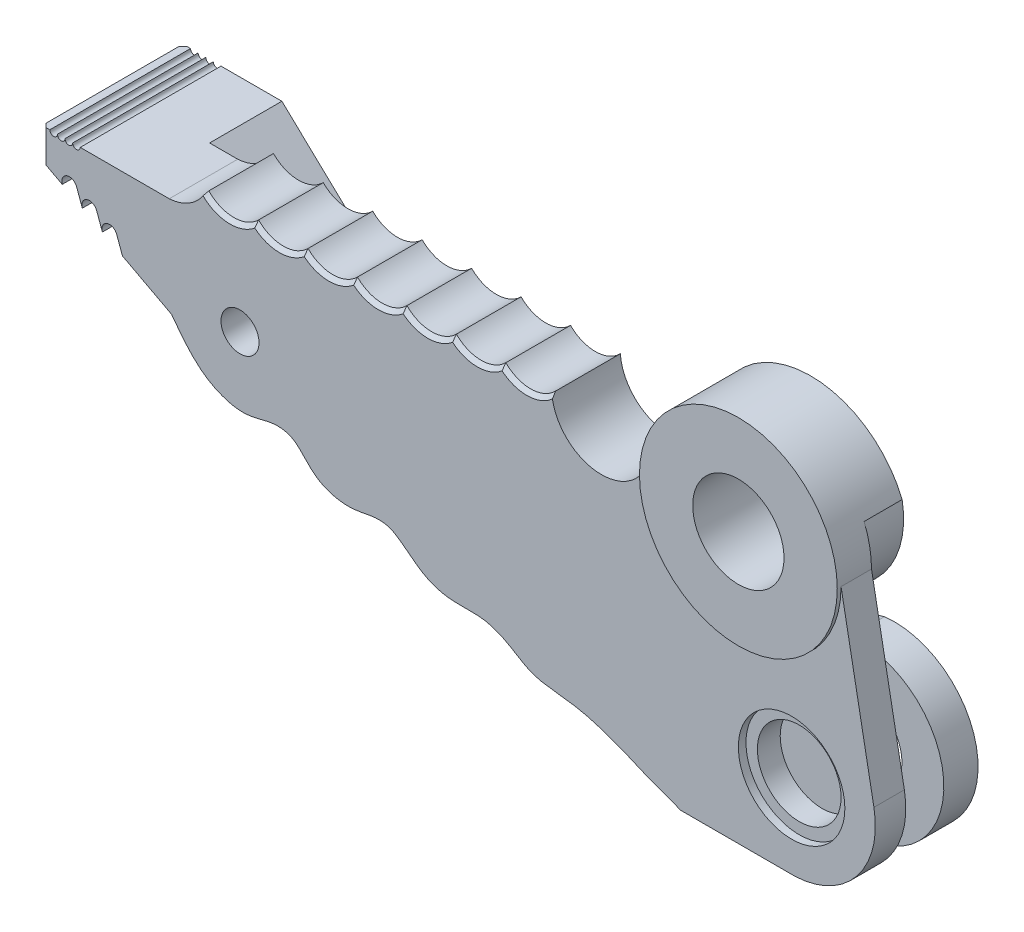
ISO-10303-21;
HEADER;
FILE_DESCRIPTION(('STEP AP214'),'2;1');
FILE_NAME('part.step','',(''),(''),'','','');
FILE_SCHEMA(('AUTOMOTIVE_DESIGN { 1 0 10303 214 1 1 1 1 }'));
ENDSEC;
DATA;
#1=APPLICATION_CONTEXT('core data for automotive mechanical design processes');
#2=APPLICATION_PROTOCOL_DEFINITION('international standard','automotive_design',2000,#1);
#3=PRODUCT_CONTEXT('',#1,'mechanical');
#4=PRODUCT('Part','Part','',(#3));
#5=PRODUCT_RELATED_PRODUCT_CATEGORY('part','',(#4));
#6=PRODUCT_DEFINITION_FORMATION('','',#4);
#7=PRODUCT_DEFINITION_CONTEXT('part definition',#1,'design');
#8=PRODUCT_DEFINITION('design','',#6,#7);
#9=PRODUCT_DEFINITION_SHAPE('','',#8);
#10=(LENGTH_UNIT() NAMED_UNIT(*) SI_UNIT(.MILLI.,.METRE.));
#11=(NAMED_UNIT(*) PLANE_ANGLE_UNIT() SI_UNIT($,.RADIAN.));
#12=(NAMED_UNIT(*) SI_UNIT($,.STERADIAN.) SOLID_ANGLE_UNIT());
#13=UNCERTAINTY_MEASURE_WITH_UNIT(LENGTH_MEASURE(1.E-05),#10,'distance_accuracy_value','');
#14=(GEOMETRIC_REPRESENTATION_CONTEXT(3) GLOBAL_UNCERTAINTY_ASSIGNED_CONTEXT((#13)) GLOBAL_UNIT_ASSIGNED_CONTEXT((#10,
#11,#12)) REPRESENTATION_CONTEXT('',''));
#15=CARTESIAN_POINT('',(0.,0.,0.));
#16=DIRECTION('',(0.,0.,1.));
#17=DIRECTION('',(1.,0.,0.));
#18=AXIS2_PLACEMENT_3D('',#15,#16,#17);
#19=CARTESIAN_POINT('',(-37.,7.0833333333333,18.));
#20=DIRECTION('',(0.,0.,-1.));
#21=DIRECTION('',(-1.,0.,0.));
#22=AXIS2_PLACEMENT_3D('',#19,#20,#21);
#23=PLANE('',#22);
#24=CARTESIAN_POINT('',(-132.,-21.,18.));
#25=DIRECTION('',(0.,0.,1.));
#26=DIRECTION('',(1.,0.,0.));
#27=AXIS2_PLACEMENT_3D('',#24,#25,#26);
#28=CIRCLE('',#27,4.99999999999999);
#29=CARTESIAN_POINT('',(-127.,-21.,18.));
#30=VERTEX_POINT('',#29);
#31=EDGE_CURVE('E742',#30,#30,#28,.T.);
#32=ORIENTED_EDGE('',*,*,#31,.F.);
#33=EDGE_LOOP('',(#32));
#34=FACE_BOUND('',#33,.T.);
#35=CARTESIAN_POINT('',(13.,-50.,18.));
#36=DIRECTION('',(0.,0.,1.));
#37=DIRECTION('',(1.,0.,0.));
#38=AXIS2_PLACEMENT_3D('',#35,#36,#37);
#39=CIRCLE('',#38,14.);
#40=CARTESIAN_POINT('',(27.,-50.,18.));
#41=VERTEX_POINT('',#40);
#42=EDGE_CURVE('E473',#41,#41,#39,.T.);
#43=ORIENTED_EDGE('',*,*,#42,.F.);
#44=EDGE_LOOP('',(#43));
#45=FACE_BOUND('',#44,.T.);
#46=CARTESIAN_POINT('',(-25.2600301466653,-68.5699897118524,18.));
#47=CARTESIAN_POINT('',(-36.9120090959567,-63.2945703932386,18.));
#48=CARTESIAN_POINT('',(-44.0332914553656,-62.1632418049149,18.));
#49=B_SPLINE_CURVE_WITH_KNOTS('',2,(#46,#47,#48),.UNSPECIFIED.,.F.,.F.,(3,3),(0.91616298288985,
1.),.UNSPECIFIED.);
#50=CARTESIAN_POINT('',(-44.0332914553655,-62.163241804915,18.));
#51=VERTEX_POINT('',#50);
#52=CARTESIAN_POINT('',(-25.2600301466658,-68.5699897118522,18.));
#53=VERTEX_POINT('',#52);
#54=EDGE_CURVE('E420',#51,#53,#49,.F.);
#55=ORIENTED_EDGE('',*,*,#54,.T.);
#56=DIRECTION('',(0.946405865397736,-0.322979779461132,0.));
#57=VECTOR('',#56,1.);
#58=CARTESIAN_POINT('',(-150.,-26.,18.));
#59=LINE('',#58,#57);
#60=CARTESIAN_POINT('',(-24.,-69.,18.));
#61=VERTEX_POINT('',#60);
#62=EDGE_CURVE('E419',#53,#61,#59,.T.);
#63=ORIENTED_EDGE('',*,*,#62,.T.);
#64=DIRECTION('',(0.934395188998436,-0.356238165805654,0.));
#65=VECTOR('',#64,1.);
#66=CARTESIAN_POINT('',(-24.,-69.,18.));
#67=LINE('',#66,#65);
#68=CARTESIAN_POINT('',(-16.1311475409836,-72.,18.));
#69=VERTEX_POINT('',#68);
#70=EDGE_CURVE('E752',#61,#69,#67,.T.);
#71=ORIENTED_EDGE('',*,*,#70,.T.);
#72=DIRECTION('',(1.,0.,0.));
#73=VECTOR('',#72,1.);
#74=CARTESIAN_POINT('',(-16.1311475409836,-72.,18.));
#75=LINE('',#74,#73);
#76=CARTESIAN_POINT('',(13.8688524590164,-72.,18.));
#77=VERTEX_POINT('',#76);
#78=EDGE_CURVE('E755',#69,#77,#75,.T.);
#79=ORIENTED_EDGE('',*,*,#78,.T.);
#80=CARTESIAN_POINT('',(13.,-50.,18.));
#81=DIRECTION('',(0.,0.,1.));
#82=DIRECTION('',(1.,0.,0.));
#83=AXIS2_PLACEMENT_3D('',#80,#81,#82);
#84=CIRCLE('',#83,22.0171502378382);
#85=CARTESIAN_POINT('',(34.6378378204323,-45.9307397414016,18.));
#86=VERTEX_POINT('',#85);
#87=EDGE_CURVE('E758',#77,#86,#84,.T.);
#88=ORIENTED_EDGE('',*,*,#87,.T.);
#89=DIRECTION('',(-0.184822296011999,0.982771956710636,0.));
#90=VECTOR('',#89,1.);
#91=CARTESIAN_POINT('',(26.,0.,18.));
#92=LINE('',#91,#90);
#93=CARTESIAN_POINT('',(26.,0.,18.));
#94=VERTEX_POINT('',#93);
#95=EDGE_CURVE('E761',#86,#94,#92,.T.);
#96=ORIENTED_EDGE('',*,*,#95,.T.);
#97=CARTESIAN_POINT('',(0.,0.,18.));
#98=DIRECTION('',(0.,0.,-1.));
#99=DIRECTION('',(-1.,0.,0.));
#100=AXIS2_PLACEMENT_3D('',#97,#98,#99);
#101=CIRCLE('',#100,26.);
#102=CARTESIAN_POINT('',(-26.,0.,18.));
#103=VERTEX_POINT('',#102);
#104=EDGE_CURVE('E42',#103,#94,#101,.F.);
#105=ORIENTED_EDGE('',*,*,#104,.F.);
#106=CARTESIAN_POINT('',(-37.,7.0833333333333,18.));
#107=DIRECTION('',(0.,0.,-1.));
#108=DIRECTION('',(-1.,0.,0.));
#109=AXIS2_PLACEMENT_3D('',#106,#107,#108);
#110=CIRCLE('',#109,13.0833333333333);
#111=CARTESIAN_POINT('',(-49.8774285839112,4.77131166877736,18.));
#112=VERTEX_POINT('',#111);
#113=EDGE_CURVE('E764',#103,#112,#110,.T.);
#114=ORIENTED_EDGE('',*,*,#113,.T.);
#115=CARTESIAN_POINT('',(-56.6192024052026,12.3792302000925,18.));
#116=DIRECTION('',(0.,0.,-1.));
#117=DIRECTION('',(-1.,0.,0.));
#118=AXIS2_PLACEMENT_3D('',#115,#116,#117);
#119=CIRCLE('',#118,10.1652318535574);
#120=CARTESIAN_POINT('',(-63.1192024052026,4.56373670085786,18.));
#121=VERTEX_POINT('',#120);
#122=EDGE_CURVE('E1146',#112,#121,#119,.T.);
#123=ORIENTED_EDGE('',*,*,#122,.T.);
#124=CARTESIAN_POINT('',(-69.6192024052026,12.3792302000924,18.));
#125=DIRECTION('',(0.,0.,-1.));
#126=DIRECTION('',(-1.,0.,0.));
#127=AXIS2_PLACEMENT_3D('',#124,#125,#126);
#128=CIRCLE('',#127,10.1652318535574);
#129=CARTESIAN_POINT('',(-76.1192024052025,4.56373670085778,18.));
#130=VERTEX_POINT('',#129);
#131=EDGE_CURVE('E1149',#121,#130,#128,.T.);
#132=ORIENTED_EDGE('',*,*,#131,.T.);
#133=CARTESIAN_POINT('',(-82.6192024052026,12.3792302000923,18.));
#134=DIRECTION('',(0.,0.,-1.));
#135=DIRECTION('',(-1.,0.,0.));
#136=AXIS2_PLACEMENT_3D('',#133,#134,#135);
#137=CIRCLE('',#136,10.1652318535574);
#138=CARTESIAN_POINT('',(-89.1192024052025,4.56373670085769,18.));
#139=VERTEX_POINT('',#138);
#140=EDGE_CURVE('E1153',#130,#139,#137,.T.);
#141=ORIENTED_EDGE('',*,*,#140,.T.);
#142=CARTESIAN_POINT('',(-95.6192024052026,12.3792302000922,18.));
#143=DIRECTION('',(0.,0.,-1.));
#144=DIRECTION('',(-1.,0.,0.));
#145=AXIS2_PLACEMENT_3D('',#142,#143,#144);
#146=CIRCLE('',#145,10.1652318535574);
#147=CARTESIAN_POINT('',(-102.119202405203,4.5637367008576,18.));
#148=VERTEX_POINT('',#147);
#149=EDGE_CURVE('E1815',#139,#148,#146,.T.);
#150=ORIENTED_EDGE('',*,*,#149,.T.);
#151=CARTESIAN_POINT('',(-108.619202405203,12.3792302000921,18.));
#152=DIRECTION('',(0.,0.,-1.));
#153=DIRECTION('',(-1.,0.,0.));
#154=AXIS2_PLACEMENT_3D('',#151,#152,#153);
#155=CIRCLE('',#154,10.1652318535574);
#156=CARTESIAN_POINT('',(-115.119202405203,4.56373670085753,18.));
#157=VERTEX_POINT('',#156);
#158=EDGE_CURVE('E1816',#148,#157,#155,.T.);
#159=ORIENTED_EDGE('',*,*,#158,.T.);
#160=CARTESIAN_POINT('',(-121.619202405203,12.379230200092,18.));
#161=DIRECTION('',(0.,0.,-1.));
#162=DIRECTION('',(-1.,0.,0.));
#163=AXIS2_PLACEMENT_3D('',#160,#161,#162);
#164=CIRCLE('',#163,10.1652318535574);
#165=CARTESIAN_POINT('',(-128.119202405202,4.56373670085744,18.));
#166=VERTEX_POINT('',#165);
#167=EDGE_CURVE('E1819',#157,#166,#164,.T.);
#168=ORIENTED_EDGE('',*,*,#167,.T.);
#169=CARTESIAN_POINT('',(-134.619202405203,12.379230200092,18.));
#170=DIRECTION('',(0.,0.,-1.));
#171=DIRECTION('',(-1.,0.,0.));
#172=AXIS2_PLACEMENT_3D('',#169,#170,#171);
#173=CIRCLE('',#172,10.1652318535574);
#174=CARTESIAN_POINT('',(-141.730715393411,5.1157378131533,18.));
#175=VERTEX_POINT('',#174);
#176=EDGE_CURVE('E865',#166,#175,#173,.T.);
#177=ORIENTED_EDGE('',*,*,#176,.T.);
#178=CARTESIAN_POINT('',(-151.300343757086,11.460618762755,18.));
#179=DIRECTION('',(0.,0.,-1.));
#180=DIRECTION('',(-1.,0.,0.));
#181=AXIS2_PLACEMENT_3D('',#178,#179,#180);
#182=CIRCLE('',#181,11.4819554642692);
#183=CARTESIAN_POINT('',(-150.600687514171,0.,18.));
#184=VERTEX_POINT('',#183);
#185=EDGE_CURVE('E502',#184,#175,#182,.F.);
#186=ORIENTED_EDGE('',*,*,#185,.F.);
#187=DIRECTION('',(-1.,0.,0.));
#188=VECTOR('',#187,1.);
#189=CARTESIAN_POINT('',(-184.,0.,18.));
#190=LINE('',#189,#188);
#191=CARTESIAN_POINT('',(-174.,0.,18.));
#192=VERTEX_POINT('',#191);
#193=EDGE_CURVE('E746',#184,#192,#190,.T.);
#194=ORIENTED_EDGE('',*,*,#193,.T.);
#195=CARTESIAN_POINT('',(-175.,0.,18.));
#196=DIRECTION('',(0.,0.,1.));
#197=DIRECTION('',(1.,0.,0.));
#198=AXIS2_PLACEMENT_3D('',#195,#196,#197);
#199=CIRCLE('',#198,0.999999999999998);
#200=CARTESIAN_POINT('',(-176.,0.,18.));
#201=VERTEX_POINT('',#200);
#202=EDGE_CURVE('E659',#201,#192,#199,.T.);
#203=ORIENTED_EDGE('',*,*,#202,.F.);
#204=CARTESIAN_POINT('',(-177.,0.,18.));
#205=DIRECTION('',(0.,0.,1.));
#206=DIRECTION('',(1.,0.,0.));
#207=AXIS2_PLACEMENT_3D('',#204,#205,#206);
#208=CIRCLE('',#207,0.999999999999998);
#209=CARTESIAN_POINT('',(-178.,0.,18.));
#210=VERTEX_POINT('',#209);
#211=EDGE_CURVE('E668',#210,#201,#208,.T.);
#212=ORIENTED_EDGE('',*,*,#211,.F.);
#213=CARTESIAN_POINT('',(-179.,0.,18.));
#214=DIRECTION('',(0.,0.,1.));
#215=DIRECTION('',(1.,0.,0.));
#216=AXIS2_PLACEMENT_3D('',#213,#214,#215);
#217=CIRCLE('',#216,0.999999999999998);
#218=CARTESIAN_POINT('',(-180.,0.,18.));
#219=VERTEX_POINT('',#218);
#220=EDGE_CURVE('E676',#219,#210,#217,.T.);
#221=ORIENTED_EDGE('',*,*,#220,.F.);
#222=CARTESIAN_POINT('',(-181.,0.,18.));
#223=DIRECTION('',(0.,0.,-1.));
#224=DIRECTION('',(-1.,0.,0.));
#225=AXIS2_PLACEMENT_3D('',#222,#223,#224);
#226=CIRCLE('',#225,0.999999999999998);
#227=CARTESIAN_POINT('',(-182.,0.,18.));
#228=VERTEX_POINT('',#227);
#229=EDGE_CURVE('E805',#219,#228,#226,.T.);
#230=ORIENTED_EDGE('',*,*,#229,.T.);
#231=CARTESIAN_POINT('',(-183.,0.,18.));
#232=VERTEX_POINT('',#231);
#233=EDGE_CURVE('E745',#228,#232,#190,.T.);
#234=ORIENTED_EDGE('',*,*,#233,.T.);
#235=DIRECTION('',(0.,-1.,0.));
#236=VECTOR('',#235,1.);
#237=CARTESIAN_POINT('',(-183.,-8.,18.));
#238=LINE('',#237,#236);
#239=CARTESIAN_POINT('',(-183.,-8.52941176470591,18.));
#240=VERTEX_POINT('',#239);
#241=EDGE_CURVE('E823',#232,#240,#238,.T.);
#242=ORIENTED_EDGE('',*,*,#241,.T.);
#243=DIRECTION('',(0.883787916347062,-0.467887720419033,0.));
#244=VECTOR('',#243,1.);
#245=CARTESIAN_POINT('',(-184.,-8.,18.));
#246=LINE('',#245,#244);
#247=CARTESIAN_POINT('',(-178.727289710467,-10.7914348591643,18.));
#248=VERTEX_POINT('',#247);
#249=EDGE_CURVE('E749',#240,#248,#246,.T.);
#250=ORIENTED_EDGE('',*,*,#249,.T.);
#251=CARTESIAN_POINT('',(-176.847904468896,-10.1073945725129,18.));
#252=DIRECTION('',(0.,0.,1.));
#253=DIRECTION('',(-1.,0.,0.));
#254=AXIS2_PLACEMENT_3D('',#251,#252,#253);
#255=CIRCLE('',#254,1.99999999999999);
#256=CARTESIAN_POINT('',(-174.968519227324,-9.42335428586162,18.));
#257=VERTEX_POINT('',#256);
#258=EDGE_CURVE('E698',#257,#248,#255,.T.);
#259=ORIENTED_EDGE('',*,*,#258,.F.);
#260=DIRECTION('',(-0.342020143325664,0.93969262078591,0.));
#261=VECTOR('',#260,1.);
#262=CARTESIAN_POINT('',(-173.454579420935,-13.5828697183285,18.));
#263=LINE('',#262,#261);
#264=CARTESIAN_POINT('',(-173.454579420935,-13.5828697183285,18.));
#265=VERTEX_POINT('',#264);
#266=EDGE_CURVE('E722',#265,#257,#263,.T.);
#267=ORIENTED_EDGE('',*,*,#266,.F.);
#268=CARTESIAN_POINT('',(-171.575194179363,-12.8988294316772,18.));
#269=DIRECTION('',(0.,0.,1.));
#270=DIRECTION('',(-1.,0.,0.));
#271=AXIS2_PLACEMENT_3D('',#268,#269,#270);
#272=CIRCLE('',#271,2.00000000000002);
#273=CARTESIAN_POINT('',(-169.695808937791,-12.2147891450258,18.));
#274=VERTEX_POINT('',#273);
#275=EDGE_CURVE('E719',#274,#265,#272,.T.);
#276=ORIENTED_EDGE('',*,*,#275,.F.);
#277=DIRECTION('',(-0.342020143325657,0.939692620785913,0.));
#278=VECTOR('',#277,1.);
#279=CARTESIAN_POINT('',(-168.181869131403,-16.3743045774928,18.));
#280=LINE('',#279,#278);
#281=CARTESIAN_POINT('',(-168.181869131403,-16.3743045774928,18.));
#282=VERTEX_POINT('',#281);
#283=EDGE_CURVE('E716',#282,#274,#280,.T.);
#284=ORIENTED_EDGE('',*,*,#283,.F.);
#285=CARTESIAN_POINT('',(-166.302483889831,-15.6902642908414,18.));
#286=DIRECTION('',(0.,0.,1.));
#287=DIRECTION('',(-1.,0.,0.));
#288=AXIS2_PLACEMENT_3D('',#285,#286,#287);
#289=CIRCLE('',#288,2.00000000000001);
#290=CARTESIAN_POINT('',(-164.423098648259,-15.0062240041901,18.));
#291=VERTEX_POINT('',#290);
#292=EDGE_CURVE('E693',#291,#282,#289,.T.);
#293=ORIENTED_EDGE('',*,*,#292,.F.);
#294=DIRECTION('',(0.342020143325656,-0.939692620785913,0.));
#295=VECTOR('',#294,1.);
#296=CARTESIAN_POINT('',(-156.616874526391,-36.4536485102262,18.));
#297=LINE('',#296,#295);
#298=CARTESIAN_POINT('',(-162.90915884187,-19.165739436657,18.));
#299=VERTEX_POINT('',#298);
#300=EDGE_CURVE('E780',#291,#299,#297,.T.);
#301=ORIENTED_EDGE('',*,*,#300,.T.);
#302=CARTESIAN_POINT('',(-150.,-26.,18.));
#303=VERTEX_POINT('',#302);
#304=EDGE_CURVE('E748',#299,#303,#246,.T.);
#305=ORIENTED_EDGE('',*,*,#304,.T.);
#306=CARTESIAN_POINT('',(-150.,-26.,18.));
#307=CARTESIAN_POINT('',(-145.454915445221,-32.3161243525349,18.));
#308=CARTESIAN_POINT('',(-141.093739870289,-36.8200016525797,18.));
#309=CARTESIAN_POINT('',(-129.072627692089,-40.0365154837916,18.));
#310=CARTESIAN_POINT('',(-124.862609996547,-36.754544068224,18.));
#311=CARTESIAN_POINT('',(-116.113323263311,-38.3797177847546,18.));
#312=CARTESIAN_POINT('',(-113.655607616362,-44.3656523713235,18.));
#313=CARTESIAN_POINT('',(-101.843433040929,-47.5208352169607,18.));
#314=CARTESIAN_POINT('',(-97.4421896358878,-44.7867613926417,18.));
#315=CARTESIAN_POINT('',(-90.2670422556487,-46.3870718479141,18.));
#316=CARTESIAN_POINT('',(-85.2228473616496,-51.9178892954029,18.));
#317=CARTESIAN_POINT('',(-75.5818368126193,-55.0367947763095,18.));
#318=CARTESIAN_POINT('',(-70.1108773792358,-53.5089063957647,18.));
#319=CARTESIAN_POINT('',(-61.1867094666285,-56.4551343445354,18.));
#320=CARTESIAN_POINT('',(-57.6043152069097,-59.6402462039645,18.));
#321=CARTESIAN_POINT('',(-51.5234459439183,-61.40699596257,18.));
#322=CARTESIAN_POINT('',(-47.778410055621,-61.5682703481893,18.));
#323=CARTESIAN_POINT('',(-44.0332914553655,-62.163241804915,18.));
#324=B_SPLINE_CURVE_WITH_KNOTS('',3,(#306,#307,#308,#309,#310,#311,#312,#313,#314,#315,#316,
#317,#318,#319,#320,#321,#322,#323),.UNSPECIFIED.,.F.,.F.,(4,1,1,1,1,1,1,1,1,1,1,1,1,1,1,4),(0.,
0.126657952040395,0.155417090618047,0.272905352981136,0.299749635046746,0.397015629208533,
0.421976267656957,0.524395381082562,0.54650269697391,0.62094211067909,0.641372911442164,
0.730379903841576,0.751623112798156,0.83256179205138,0.850027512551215,0.916162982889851),.UNSPECIFIED.);
#325=EDGE_CURVE('E428',#303,#51,#324,.T.);
#326=ORIENTED_EDGE('',*,*,#325,.T.);
#327=EDGE_LOOP('',(#55,#63,#71,#79,#88,#96,#105,#114,#123,#132,#141,#150,#159,#168,#177,#186,
#194,#203,#212,#221,#230,#234,#242,#250,#259,#267,#276,#284,#293,#301,#305,#326));
#328=FACE_BOUND('',#327,.T.);
#329=ADVANCED_FACE('F33',(#34,#45,#328),#23,.F.);
#330=CARTESIAN_POINT('',(-150.,-26.,-19.));
#331=DIRECTION('',(-0.322979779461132,-0.946405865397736,0.));
#332=DIRECTION('',(0.946405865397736,-0.322979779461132,0.));
#333=AXIS2_PLACEMENT_3D('',#330,#331,#332);
#334=PLANE('',#333);
#335=DIRECTION('',(0.,0.,-1.));
#336=VECTOR('',#335,1.);
#337=CARTESIAN_POINT('',(-25.2600301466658,-68.5699897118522,37.836374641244));
#338=LINE('',#337,#336);
#339=CARTESIAN_POINT('',(-25.2600301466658,-68.5699897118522,0.));
#340=VERTEX_POINT('',#339);
#341=EDGE_CURVE('E408',#53,#340,#338,.T.);
#342=ORIENTED_EDGE('',*,*,#341,.T.);
#343=DIRECTION('',(0.946405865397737,-0.322979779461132,0.));
#344=VECTOR('',#343,1.);
#345=CARTESIAN_POINT('',(-44.0332914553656,-62.1632418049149,0.));
#346=LINE('',#345,#344);
#347=CARTESIAN_POINT('',(-29.8675164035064,-66.9975936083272,0.));
#348=VERTEX_POINT('',#347);
#349=EDGE_CURVE('E401',#348,#340,#346,.T.);
#350=ORIENTED_EDGE('',*,*,#349,.F.);
#351=DIRECTION('',(0.,0.,-1.));
#352=VECTOR('',#351,1.);
#353=CARTESIAN_POINT('',(-29.8675164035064,-66.9975936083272,-9.));
#354=LINE('',#353,#352);
#355=CARTESIAN_POINT('',(-29.8675164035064,-66.9975936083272,-9.));
#356=VERTEX_POINT('',#355);
#357=EDGE_CURVE('E847',#348,#356,#354,.T.);
#358=ORIENTED_EDGE('',*,*,#357,.T.);
#359=DIRECTION('',(0.946405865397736,-0.322979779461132,0.));
#360=VECTOR('',#359,1.);
#361=CARTESIAN_POINT('',(-150.,-26.,-9.));
#362=LINE('',#361,#360);
#363=CARTESIAN_POINT('',(-24.,-69.,-9.));
#364=VERTEX_POINT('',#363);
#365=EDGE_CURVE('E648',#356,#364,#362,.T.);
#366=ORIENTED_EDGE('',*,*,#365,.T.);
#367=DIRECTION('',(0.,0.,1.));
#368=VECTOR('',#367,1.);
#369=CARTESIAN_POINT('',(-24.,-69.,-19.));
#370=LINE('',#369,#368);
#371=CARTESIAN_POINT('',(-24.,-69.,0.));
#372=VERTEX_POINT('',#371);
#373=EDGE_CURVE('E793',#364,#372,#370,.T.);
#374=ORIENTED_EDGE('',*,*,#373,.T.);
#375=DIRECTION('',(0.,0.,-1.));
#376=VECTOR('',#375,1.);
#377=CARTESIAN_POINT('',(-24.,-69.,10.));
#378=LINE('',#377,#376);
#379=CARTESIAN_POINT('',(-24.,-69.,10.));
#380=VERTEX_POINT('',#379);
#381=EDGE_CURVE('E630',#380,#372,#378,.T.);
#382=ORIENTED_EDGE('',*,*,#381,.F.);
#383=EDGE_CURVE('E795',#380,#61,#370,.T.);
#384=ORIENTED_EDGE('',*,*,#383,.T.);
#385=ORIENTED_EDGE('',*,*,#62,.F.);
#386=EDGE_LOOP('',(#342,#350,#358,#366,#374,#382,#384,#385));
#387=FACE_BOUND('',#386,.T.);
#388=ADVANCED_FACE('F417',(#387),#334,.T.);
#389=CARTESIAN_POINT('',(-144.56651860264,-25.7410250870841,1.));
#390=DIRECTION('',(0.,0.,-1.));
#391=DIRECTION('',(-1.,0.,0.));
#392=AXIS2_PLACEMENT_3D('',#389,#390,#391);
#393=PLANE('',#392);
#394=CARTESIAN_POINT('',(-132.,-21.,1.));
#395=DIRECTION('',(0.,0.,-1.));
#396=DIRECTION('',(-1.,0.,0.));
#397=AXIS2_PLACEMENT_3D('',#394,#395,#396);
#398=CIRCLE('',#397,4.99999999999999);
#399=CARTESIAN_POINT('',(-137.,-21.,1.));
#400=VERTEX_POINT('',#399);
#401=EDGE_CURVE('E588',#400,#400,#398,.F.);
#402=ORIENTED_EDGE('',*,*,#401,.T.);
#403=EDGE_LOOP('',(#402));
#404=FACE_BOUND('',#403,.T.);
#405=CARTESIAN_POINT('',(-29.2215568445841,-65.1047818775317,1.));
#406=DIRECTION('',(0.,0.,-1.));
#407=DIRECTION('',(-1.,0.,0.));
#408=AXIS2_PLACEMENT_3D('',#405,#406,#407);
#409=CIRCLE('',#408,2.);
#410=CARTESIAN_POINT('',(-31.2093243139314,-64.883918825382,1.));
#411=VERTEX_POINT('',#410);
#412=CARTESIAN_POINT('',(-30.9335839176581,-66.1386886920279,1.));
#413=VERTEX_POINT('',#412);
#414=EDGE_CURVE('E852',#411,#413,#409,.F.);
#415=ORIENTED_EDGE('',*,*,#414,.T.);
#416=CARTESIAN_POINT('',(-25.2600301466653,-68.5699897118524,1.));
#417=CARTESIAN_POINT('',(-36.9120090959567,-63.2945703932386,1.));
#418=CARTESIAN_POINT('',(-44.0332914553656,-62.1632418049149,1.));
#419=B_SPLINE_CURVE_WITH_KNOTS('',2,(#416,#417,#418),.UNSPECIFIED.,.F.,.F.,(3,3),
(0.91616298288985,1.),.UNSPECIFIED.);
#420=CARTESIAN_POINT('',(-44.0332914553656,-62.1632418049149,1.));
#421=VERTEX_POINT('',#420);
#422=EDGE_CURVE('E425',#413,#421,#419,.T.);
#423=ORIENTED_EDGE('',*,*,#422,.T.);
#424=CARTESIAN_POINT('',(-150.,-26.,0.999999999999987));
#425=CARTESIAN_POINT('',(-145.454915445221,-32.3161243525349,0.999999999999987));
#426=CARTESIAN_POINT('',(-141.093739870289,-36.8200016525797,0.999999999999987));
#427=CARTESIAN_POINT('',(-129.072627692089,-40.0365154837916,0.999999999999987));
#428=CARTESIAN_POINT('',(-124.862609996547,-36.754544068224,0.999999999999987));
#429=CARTESIAN_POINT('',(-116.113323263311,-38.3797177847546,0.999999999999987));
#430=CARTESIAN_POINT('',(-113.655607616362,-44.3656523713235,0.999999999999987));
#431=CARTESIAN_POINT('',(-101.843433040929,-47.5208352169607,0.999999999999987));
#432=CARTESIAN_POINT('',(-97.4421896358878,-44.7867613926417,0.999999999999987));
#433=CARTESIAN_POINT('',(-90.2670422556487,-46.3870718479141,0.999999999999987));
#434=CARTESIAN_POINT('',(-85.2228473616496,-51.9178892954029,0.999999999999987));
#435=CARTESIAN_POINT('',(-75.5818368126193,-55.0367947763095,0.999999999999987));
#436=CARTESIAN_POINT('',(-70.1108773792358,-53.5089063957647,0.999999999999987));
#437=CARTESIAN_POINT('',(-61.1867094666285,-56.4551343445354,0.999999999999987));
#438=CARTESIAN_POINT('',(-57.6043152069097,-59.6402462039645,0.999999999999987));
#439=CARTESIAN_POINT('',(-51.5234459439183,-61.40699596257,0.999999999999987));
#440=CARTESIAN_POINT('',(-47.778410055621,-61.5682703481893,0.999999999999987));
#441=CARTESIAN_POINT('',(-44.0332914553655,-62.163241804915,0.999999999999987));
#442=B_SPLINE_CURVE_WITH_KNOTS('',3,(#424,#425,#426,#427,#428,#429,#430,#431,#432,#433,#434,
#435,#436,#437,#438,#439,#440,#441),.UNSPECIFIED.,.F.,.F.,(4,1,1,1,1,1,1,1,1,1,1,1,1,1,1,4),(0.,
0.126657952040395,0.155417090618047,0.272905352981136,0.299749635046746,0.397015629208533,
0.421976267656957,0.524395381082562,0.54650269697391,0.62094211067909,0.641372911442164,
0.730379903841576,0.751623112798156,0.83256179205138,0.850027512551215,0.916162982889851),.UNSPECIFIED.);
#443=CARTESIAN_POINT('',(-150.,-26.,1.));
#444=VERTEX_POINT('',#443);
#445=EDGE_CURVE('E458',#444,#421,#442,.T.);
#446=ORIENTED_EDGE('',*,*,#445,.F.);
#447=DIRECTION('',(-0.946405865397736,0.322979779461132,0.));
#448=VECTOR('',#447,1.);
#449=CARTESIAN_POINT('',(-150.,-26.,1.));
#450=LINE('',#449,#448);
#451=CARTESIAN_POINT('',(-145.212478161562,-27.6338368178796,1.));
#452=VERTEX_POINT('',#451);
#453=EDGE_CURVE('E440',#452,#444,#450,.T.);
#454=ORIENTED_EDGE('',*,*,#453,.F.);
#455=CARTESIAN_POINT('',(-144.56651860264,-25.7410250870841,1.));
#456=DIRECTION('',(0.,0.,1.));
#457=DIRECTION('',(-1.,0.,0.));
#458=AXIS2_PLACEMENT_3D('',#455,#456,#457);
#459=CIRCLE('',#458,2.00000000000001);
#460=CARTESIAN_POINT('',(-142.642872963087,-26.2883709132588,1.));
#461=VERTEX_POINT('',#460);
#462=EDGE_CURVE('E571',#452,#461,#459,.T.);
#463=ORIENTED_EDGE('',*,*,#462,.T.);
#464=DIRECTION('',(0.273672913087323,0.96182281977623,0.));
#465=VECTOR('',#464,1.);
#466=CARTESIAN_POINT('',(-142.642872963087,-26.2883709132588,1.));
#467=LINE('',#466,#465);
#468=CARTESIAN_POINT('',(-141.059180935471,-20.7224889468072,1.));
#469=VERTEX_POINT('',#468);
#470=EDGE_CURVE('E574',#461,#469,#467,.T.);
#471=ORIENTED_EDGE('',*,*,#470,.T.);
#472=CARTESIAN_POINT('',(-129.661294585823,-25.1436133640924,1.));
#473=DIRECTION('',(0.,0.,-1.));
#474=DIRECTION('',(1.,0.,0.));
#475=AXIS2_PLACEMENT_3D('',#472,#473,#474);
#476=CIRCLE('',#475,12.2253079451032);
#477=CARTESIAN_POINT('',(-131.072254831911,-13.,1.));
#478=VERTEX_POINT('',#477);
#479=EDGE_CURVE('E577',#469,#478,#476,.T.);
#480=ORIENTED_EDGE('',*,*,#479,.T.);
#481=DIRECTION('',(1.,0.,0.));
#482=VECTOR('',#481,1.);
#483=CARTESIAN_POINT('',(-25.4444444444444,-13.,1.));
#484=LINE('',#483,#482);
#485=CARTESIAN_POINT('',(-27.6789744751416,-13.,1.));
#486=VERTEX_POINT('',#485);
#487=EDGE_CURVE('E580',#478,#486,#484,.T.);
#488=ORIENTED_EDGE('',*,*,#487,.T.);
#489=CARTESIAN_POINT('',(-27.6789744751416,-15.,1.));
#490=DIRECTION('',(0.,0.,-1.));
#491=DIRECTION('',(-1.,0.,0.));
#492=AXIS2_PLACEMENT_3D('',#489,#490,#491);
#493=CIRCLE('',#492,2.);
#494=CARTESIAN_POINT('',(-25.6912070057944,-15.2208630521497,1.));
#495=VERTEX_POINT('',#494);
#496=EDGE_CURVE('E845',#486,#495,#493,.T.);
#497=ORIENTED_EDGE('',*,*,#496,.T.);
#498=DIRECTION('',(-0.110431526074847,-0.993883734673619,0.));
#499=VECTOR('',#498,1.);
#500=CARTESIAN_POINT('',(-25.4444444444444,-13.,1.));
#501=LINE('',#500,#499);
#502=EDGE_CURVE('E568',#495,#411,#501,.T.);
#503=ORIENTED_EDGE('',*,*,#502,.T.);
#504=EDGE_LOOP('',(#415,#423,#446,#454,#463,#471,#480,#488,#497,#503));
#505=FACE_BOUND('',#504,.T.);
#506=ADVANCED_FACE('F965',(#404,#505),#393,.T.);
#507=CARTESIAN_POINT('',(-29.2215568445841,-65.1047818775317,-19.));
#508=DIRECTION('',(0.,0.,1.));
#509=DIRECTION('',(1.,0.,0.));
#510=AXIS2_PLACEMENT_3D('',#507,#508,#509);
#511=CYLINDRICAL_SURFACE('',#510,2.);
#512=ORIENTED_EDGE('',*,*,#357,.F.);
#513=CARTESIAN_POINT('',(-29.2215568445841,-65.1047818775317,0.));
#514=DIRECTION('',(0.,0.,1.));
#515=DIRECTION('',(1.,0.,0.));
#516=AXIS2_PLACEMENT_3D('',#513,#514,#515);
#517=CIRCLE('',#516,2.);
#518=CARTESIAN_POINT('',(-30.9335839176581,-66.1386886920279,0.));
#519=VERTEX_POINT('',#518);
#520=EDGE_CURVE('E11',#348,#519,#517,.F.);
#521=ORIENTED_EDGE('',*,*,#520,.T.);
#522=DIRECTION('',(0.,0.,-1.));
#523=VECTOR('',#522,1.);
#524=CARTESIAN_POINT('',(-30.9335839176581,-66.1386886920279,9.));
#525=LINE('',#524,#523);
#526=EDGE_CURVE('E414',#519,#413,#525,.F.);
#527=ORIENTED_EDGE('',*,*,#526,.T.);
#528=ORIENTED_EDGE('',*,*,#414,.F.);
#529=DIRECTION('',(0.,0.,-1.));
#530=VECTOR('',#529,1.);
#531=CARTESIAN_POINT('',(-31.2093243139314,-64.883918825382,1.));
#532=LINE('',#531,#530);
#533=CARTESIAN_POINT('',(-31.2093243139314,-64.883918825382,-9.));
#534=VERTEX_POINT('',#533);
#535=EDGE_CURVE('E834',#534,#411,#532,.F.);
#536=ORIENTED_EDGE('',*,*,#535,.F.);
#537=CARTESIAN_POINT('',(-29.2215568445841,-65.1047818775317,-9.));
#538=DIRECTION('',(0.,0.,-1.));
#539=DIRECTION('',(-1.,0.,0.));
#540=AXIS2_PLACEMENT_3D('',#537,#538,#539);
#541=CIRCLE('',#540,2.);
#542=EDGE_CURVE('E849',#356,#534,#541,.T.);
#543=ORIENTED_EDGE('',*,*,#542,.F.);
#544=EDGE_LOOP('',(#512,#521,#527,#528,#536,#543));
#545=FACE_BOUND('',#544,.T.);
#546=ADVANCED_FACE('F1183',(#545),#511,.T.);
#547=ORIENTED_EDGE('',*,*,#453,.T.);
#548=DIRECTION('',(0.,0.,1.));
#549=VECTOR('',#548,1.);
#550=CARTESIAN_POINT('',(-150.,-26.,-19.));
#551=LINE('',#550,#549);
#552=CARTESIAN_POINT('',(-150.,-26.,-19.));
#553=VERTEX_POINT('',#552);
#554=EDGE_CURVE('E455',#553,#444,#551,.T.);
#555=ORIENTED_EDGE('',*,*,#554,.F.);
#556=DIRECTION('',(0.946405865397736,-0.322979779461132,0.));
#557=VECTOR('',#556,1.);
#558=CARTESIAN_POINT('',(-150.,-26.,-19.));
#559=LINE('',#558,#557);
#560=CARTESIAN_POINT('',(-145.212478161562,-27.6338368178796,-19.));
#561=VERTEX_POINT('',#560);
#562=EDGE_CURVE('E773',#553,#561,#559,.T.);
#563=ORIENTED_EDGE('',*,*,#562,.T.);
#564=DIRECTION('',(0.,0.,-1.));
#565=VECTOR('',#564,1.);
#566=CARTESIAN_POINT('',(-145.212478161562,-27.6338368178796,-9.));
#567=LINE('',#566,#565);
#568=EDGE_CURVE('E831',#561,#452,#567,.F.);
#569=ORIENTED_EDGE('',*,*,#568,.T.);
#570=EDGE_LOOP('',(#547,#555,#563,#569));
#571=FACE_BOUND('',#570,.T.);
#572=ADVANCED_FACE('F967',(#571),#334,.T.);
#573=CARTESIAN_POINT('',(13.,-50.,-19.));
#574=DIRECTION('',(0.,0.,1.));
#575=DIRECTION('',(1.,0.,0.));
#576=AXIS2_PLACEMENT_3D('',#573,#574,#575);
#577=CYLINDRICAL_SURFACE('',#576,11.);
#578=CARTESIAN_POINT('',(13.,-50.,10.));
#579=DIRECTION('',(0.,0.,-1.));
#580=DIRECTION('',(-1.,0.,0.));
#581=AXIS2_PLACEMENT_3D('',#578,#579,#580);
#582=CIRCLE('',#581,11.);
#583=CARTESIAN_POINT('',(2.00000000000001,-50.,10.));
#584=VERTEX_POINT('',#583);
#585=EDGE_CURVE('E637',#584,#584,#582,.F.);
#586=ORIENTED_EDGE('',*,*,#585,.F.);
#587=EDGE_LOOP('',(#586));
#588=FACE_BOUND('',#587,.T.);
#589=CARTESIAN_POINT('',(13.,-50.,16.));
#590=DIRECTION('',(0.,0.,1.));
#591=DIRECTION('',(1.,0.,0.));
#592=AXIS2_PLACEMENT_3D('',#589,#590,#591);
#593=CIRCLE('',#592,11.);
#594=CARTESIAN_POINT('',(24.,-50.,16.));
#595=VERTEX_POINT('',#594);
#596=EDGE_CURVE('E481',#595,#595,#593,.F.);
#597=ORIENTED_EDGE('',*,*,#596,.F.);
#598=EDGE_LOOP('',(#597));
#599=FACE_BOUND('',#598,.T.);
#600=ADVANCED_FACE('F980',(#588,#599),#577,.F.);
#601=CARTESIAN_POINT('',(0.,0.,-19.));
#602=DIRECTION('',(0.,0.,1.));
#603=DIRECTION('',(1.,0.,0.));
#604=AXIS2_PLACEMENT_3D('',#601,#602,#603);
#605=CYLINDRICAL_SURFACE('',#604,26.);
#606=DIRECTION('',(0.,0.,-1.));
#607=VECTOR('',#606,1.);
#608=CARTESIAN_POINT('',(24.0597070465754,9.8554805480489,10.));
#609=LINE('',#608,#607);
#610=CARTESIAN_POINT('',(24.0597070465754,9.8554805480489,10.));
#611=VERTEX_POINT('',#610);
#612=CARTESIAN_POINT('',(24.0597070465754,9.8554805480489,0.));
#613=VERTEX_POINT('',#612);
#614=EDGE_CURVE('E627',#611,#613,#609,.T.);
#615=ORIENTED_EDGE('',*,*,#614,.T.);
#616=CARTESIAN_POINT('',(0.,0.,0.));
#617=DIRECTION('',(0.,0.,-1.));
#618=DIRECTION('',(-1.,0.,0.));
#619=AXIS2_PLACEMENT_3D('',#616,#617,#618);
#620=CIRCLE('',#619,26.);
#621=CARTESIAN_POINT('',(-26.,0.,0.));
#622=VERTEX_POINT('',#621);
#623=EDGE_CURVE('E556',#622,#613,#620,.T.);
#624=ORIENTED_EDGE('',*,*,#623,.F.);
#625=DIRECTION('',(0.,0.,1.));
#626=VECTOR('',#625,1.);
#627=CARTESIAN_POINT('',(-26.,0.,-19.));
#628=LINE('',#627,#626);
#629=EDGE_CURVE('E777',#622,#103,#628,.T.);
#630=ORIENTED_EDGE('',*,*,#629,.T.);
#631=ORIENTED_EDGE('',*,*,#104,.T.);
#632=DIRECTION('',(0.,0.,1.));
#633=VECTOR('',#632,1.);
#634=CARTESIAN_POINT('',(26.,0.,-19.));
#635=LINE('',#634,#633);
#636=CARTESIAN_POINT('',(26.,0.,10.));
#637=VERTEX_POINT('',#636);
#638=EDGE_CURVE('E781',#637,#94,#635,.T.);
#639=ORIENTED_EDGE('',*,*,#638,.F.);
#640=CARTESIAN_POINT('',(0.,0.,10.));
#641=DIRECTION('',(0.,0.,1.));
#642=DIRECTION('',(1.,0.,0.));
#643=AXIS2_PLACEMENT_3D('',#640,#641,#642);
#644=CIRCLE('',#643,26.);
#645=EDGE_CURVE('E609',#637,#611,#644,.T.);
#646=ORIENTED_EDGE('',*,*,#645,.T.);
#647=EDGE_LOOP('',(#615,#624,#630,#631,#639,#646));
#648=FACE_BOUND('',#647,.T.);
#649=CARTESIAN_POINT('',(0.,0.,19.));
#650=DIRECTION('',(0.,0.,1.));
#651=DIRECTION('',(1.,0.,0.));
#652=AXIS2_PLACEMENT_3D('',#649,#650,#651);
#653=CIRCLE('',#652,26.);
#654=CARTESIAN_POINT('',(26.,0.,19.));
#655=VERTEX_POINT('',#654);
#656=EDGE_CURVE('E486',#655,#655,#653,.T.);
#657=ORIENTED_EDGE('',*,*,#656,.F.);
#658=EDGE_LOOP('',(#657));
#659=FACE_BOUND('',#658,.T.);
#660=ADVANCED_FACE('F984',(#648,#659),#605,.T.);
#661=CARTESIAN_POINT('',(0.,0.,-19.));
#662=DIRECTION('',(0.,0.,1.));
#663=DIRECTION('',(1.,0.,0.));
#664=AXIS2_PLACEMENT_3D('',#661,#662,#663);
#665=CYLINDRICAL_SURFACE('',#664,12.);
#666=CARTESIAN_POINT('',(0.,0.,0.));
#667=DIRECTION('',(0.,0.,-1.));
#668=DIRECTION('',(-1.,0.,0.));
#669=AXIS2_PLACEMENT_3D('',#666,#667,#668);
#670=CIRCLE('',#669,12.);
#671=CARTESIAN_POINT('',(-12.,0.,0.));
#672=VERTEX_POINT('',#671);
#673=EDGE_CURVE('E498',#672,#672,#670,.F.);
#674=ORIENTED_EDGE('',*,*,#673,.F.);
#675=EDGE_LOOP('',(#674));
#676=FACE_BOUND('',#675,.T.);
#677=CARTESIAN_POINT('',(0.,0.,19.));
#678=DIRECTION('',(0.,0.,1.));
#679=DIRECTION('',(1.,0.,0.));
#680=AXIS2_PLACEMENT_3D('',#677,#678,#679);
#681=CIRCLE('',#680,12.);
#682=CARTESIAN_POINT('',(12.,0.,19.));
#683=VERTEX_POINT('',#682);
#684=EDGE_CURVE('E483',#683,#683,#681,.T.);
#685=ORIENTED_EDGE('',*,*,#684,.T.);
#686=EDGE_LOOP('',(#685));
#687=FACE_BOUND('',#686,.T.);
#688=ADVANCED_FACE('F981',(#676,#687),#665,.F.);
#689=CARTESIAN_POINT('',(-184.,0.,-19.));
#690=DIRECTION('',(0.,1.,0.));
#691=DIRECTION('',(0.,0.,1.));
#692=AXIS2_PLACEMENT_3D('',#689,#690,#691);
#693=PLANE('',#692);
#694=ORIENTED_EDGE('',*,*,#193,.F.);
#695=DIRECTION('',(0.,0.,-1.));
#696=VECTOR('',#695,1.);
#697=CARTESIAN_POINT('',(-150.600687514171,0.,120.775975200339));
#698=LINE('',#697,#696);
#699=CARTESIAN_POINT('',(-150.600687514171,0.,0.));
#700=VERTEX_POINT('',#699);
#701=EDGE_CURVE('E535',#184,#700,#698,.T.);
#702=ORIENTED_EDGE('',*,*,#701,.T.);
#703=DIRECTION('',(1.,0.,0.));
#704=VECTOR('',#703,1.);
#705=CARTESIAN_POINT('',(-48.,0.,0.));
#706=LINE('',#705,#704);
#707=CARTESIAN_POINT('',(-158.,0.,0.));
#708=VERTEX_POINT('',#707);
#709=EDGE_CURVE('E551',#708,#700,#706,.T.);
#710=ORIENTED_EDGE('',*,*,#709,.F.);
#711=DIRECTION('',(0.,0.,-1.));
#712=VECTOR('',#711,1.);
#713=CARTESIAN_POINT('',(-158.,0.,-9.));
#714=LINE('',#713,#712);
#715=CARTESIAN_POINT('',(-158.,0.,-19.));
#716=VERTEX_POINT('',#715);
#717=EDGE_CURVE('E640',#708,#716,#714,.T.);
#718=ORIENTED_EDGE('',*,*,#717,.T.);
#719=DIRECTION('',(-1.,0.,0.));
#720=VECTOR('',#719,1.);
#721=CARTESIAN_POINT('',(-184.,0.,-19.));
#722=LINE('',#721,#720);
#723=CARTESIAN_POINT('',(-174.,0.,-19.));
#724=VERTEX_POINT('',#723);
#725=EDGE_CURVE('E768',#716,#724,#722,.T.);
#726=ORIENTED_EDGE('',*,*,#725,.T.);
#727=DIRECTION('',(0.,0.,1.));
#728=VECTOR('',#727,1.);
#729=CARTESIAN_POINT('',(-174.,0.,-19.));
#730=LINE('',#729,#728);
#731=EDGE_CURVE('E662',#192,#724,#730,.F.);
#732=ORIENTED_EDGE('',*,*,#731,.F.);
#733=EDGE_LOOP('',(#694,#702,#710,#718,#726,#732));
#734=FACE_BOUND('',#733,.T.);
#735=ADVANCED_FACE('F983',(#734),#693,.T.);
#736=CARTESIAN_POINT('',(-37.,7.0833333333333,-19.));
#737=DIRECTION('',(0.,0.,1.));
#738=DIRECTION('',(1.,0.,0.));
#739=AXIS2_PLACEMENT_3D('',#736,#737,#738);
#740=CYLINDRICAL_SURFACE('',#739,13.0833333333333);
#741=DIRECTION('',(0.,0.,-1.));
#742=VECTOR('',#741,1.);
#743=CARTESIAN_POINT('',(-50.0384048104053,5.99999999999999,120.775975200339));
#744=LINE('',#743,#742);
#745=CARTESIAN_POINT('',(-50.0384048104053,5.99999999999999,17.));
#746=VERTEX_POINT('',#745);
#747=CARTESIAN_POINT('',(-50.0384048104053,5.99999999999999,0.));
#748=VERTEX_POINT('',#747);
#749=EDGE_CURVE('E533',#746,#748,#744,.T.);
#750=ORIENTED_EDGE('',*,*,#749,.F.);
#751=CARTESIAN_POINT('',(-50.0384048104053,6.,17.));
#752=CARTESIAN_POINT('',(-50.0296193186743,5.89429363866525,17.0798902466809));
#753=CARTESIAN_POINT('',(-50.0196186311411,5.78947825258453,17.1608141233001));
#754=CARTESIAN_POINT('',(-49.9972803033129,5.58158217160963,17.3244256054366));
#755=CARTESIAN_POINT('',(-49.9849440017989,5.47850051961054,17.4071121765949));
#756=CARTESIAN_POINT('',(-49.9580180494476,5.27390715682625,17.574034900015));
#757=CARTESIAN_POINT('',(-49.9434284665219,5.17239539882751,17.658271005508));
#758=CARTESIAN_POINT('',(-49.9120558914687,4.97079353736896,17.8281449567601));
#759=CARTESIAN_POINT('',(-49.8952716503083,4.87070427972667,17.9137835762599));
#760=CARTESIAN_POINT('',(-49.8774285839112,4.77131166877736,18.));
#761=B_SPLINE_CURVE_WITH_KNOTS('',3,(#751,#752,#753,#754,#755,#756,#757,#758,#759,#760),
.UNSPECIFIED.,.F.,.F.,(4,2,2,2,4),(0.,0.398350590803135,0.796473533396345,1.19458447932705,
1.59292299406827),.UNSPECIFIED.);
#762=EDGE_CURVE('E858',#746,#112,#761,.T.);
#763=ORIENTED_EDGE('',*,*,#762,.T.);
#764=ORIENTED_EDGE('',*,*,#113,.F.);
#765=ORIENTED_EDGE('',*,*,#629,.F.);
#766=CARTESIAN_POINT('',(-37.,7.0833333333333,0.));
#767=DIRECTION('',(0.,0.,1.));
#768=DIRECTION('',(-1.,0.,0.));
#769=AXIS2_PLACEMENT_3D('',#766,#767,#768);
#770=CIRCLE('',#769,13.0833333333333);
#771=EDGE_CURVE('E554',#748,#622,#770,.T.);
#772=ORIENTED_EDGE('',*,*,#771,.F.);
#773=EDGE_LOOP('',(#750,#763,#764,#765,#772));
#774=FACE_BOUND('',#773,.T.);
#775=ADVANCED_FACE('F867',(#774),#740,.F.);
#776=CARTESIAN_POINT('',(-25.4444444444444,-13.,1.));
#777=DIRECTION('',(0.,1.,0.));
#778=DIRECTION('',(0.,0.,1.));
#779=AXIS2_PLACEMENT_3D('',#776,#777,#778);
#780=PLANE('',#779);
#781=DIRECTION('',(-1.,0.,0.));
#782=VECTOR('',#781,1.);
#783=CARTESIAN_POINT('',(-131.072254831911,-13.,0.));
#784=LINE('',#783,#782);
#785=CARTESIAN_POINT('',(-27.6789744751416,-13.,0.));
#786=VERTEX_POINT('',#785);
#787=CARTESIAN_POINT('',(-131.072254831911,-13.,0.));
#788=VERTEX_POINT('',#787);
#789=EDGE_CURVE('E560',#786,#788,#784,.T.);
#790=ORIENTED_EDGE('',*,*,#789,.F.);
#791=DIRECTION('',(0.,0.,-1.));
#792=VECTOR('',#791,1.);
#793=CARTESIAN_POINT('',(-27.6789744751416,-13.,1.));
#794=LINE('',#793,#792);
#795=EDGE_CURVE('E843',#786,#486,#794,.F.);
#796=ORIENTED_EDGE('',*,*,#795,.T.);
#797=ORIENTED_EDGE('',*,*,#487,.F.);
#798=DIRECTION('',(0.,0.,-1.));
#799=VECTOR('',#798,1.);
#800=CARTESIAN_POINT('',(-131.072254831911,-13.,1.));
#801=LINE('',#800,#799);
#802=EDGE_CURVE('E585',#478,#788,#801,.T.);
#803=ORIENTED_EDGE('',*,*,#802,.T.);
#804=EDGE_LOOP('',(#790,#796,#797,#803));
#805=FACE_BOUND('',#804,.T.);
#806=ADVANCED_FACE('F1397',(#805),#780,.F.);
#807=CARTESIAN_POINT('',(-129.661294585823,-25.1436133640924,1.));
#808=DIRECTION('',(0.,0.,-1.));
#809=DIRECTION('',(-1.,0.,0.));
#810=AXIS2_PLACEMENT_3D('',#807,#808,#809);
#811=CYLINDRICAL_SURFACE('',#810,12.2253079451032);
#812=CARTESIAN_POINT('',(-129.661294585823,-25.1436133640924,0.));
#813=DIRECTION('',(0.,0.,1.));
#814=DIRECTION('',(-1.,0.,0.));
#815=AXIS2_PLACEMENT_3D('',#812,#813,#814);
#816=CIRCLE('',#815,12.2253079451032);
#817=CARTESIAN_POINT('',(-141.059180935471,-20.7224889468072,0.));
#818=VERTEX_POINT('',#817);
#819=EDGE_CURVE('E562',#788,#818,#816,.T.);
#820=ORIENTED_EDGE('',*,*,#819,.F.);
#821=ORIENTED_EDGE('',*,*,#802,.F.);
#822=ORIENTED_EDGE('',*,*,#479,.F.);
#823=DIRECTION('',(0.,0.,-1.));
#824=VECTOR('',#823,1.);
#825=CARTESIAN_POINT('',(-141.059180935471,-20.7224889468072,1.));
#826=LINE('',#825,#824);
#827=EDGE_CURVE('E583',#469,#818,#826,.T.);
#828=ORIENTED_EDGE('',*,*,#827,.T.);
#829=EDGE_LOOP('',(#820,#821,#822,#828));
#830=FACE_BOUND('',#829,.T.);
#831=ADVANCED_FACE('F1019',(#830),#811,.F.);
#832=CARTESIAN_POINT('',(-27.6789744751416,-15.,1.));
#833=DIRECTION('',(0.,0.,1.));
#834=DIRECTION('',(1.,0.,0.));
#835=AXIS2_PLACEMENT_3D('',#832,#833,#834);
#836=CYLINDRICAL_SURFACE('',#835,2.);
#837=CARTESIAN_POINT('',(-27.6789744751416,-15.,0.));
#838=DIRECTION('',(0.,0.,1.));
#839=DIRECTION('',(-1.,0.,0.));
#840=AXIS2_PLACEMENT_3D('',#837,#838,#839);
#841=CIRCLE('',#840,2.);
#842=CARTESIAN_POINT('',(-25.6912070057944,-15.2208630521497,0.));
#843=VERTEX_POINT('',#842);
#844=EDGE_CURVE('E558',#843,#786,#841,.T.);
#845=ORIENTED_EDGE('',*,*,#844,.F.);
#846=DIRECTION('',(0.,0.,-1.));
#847=VECTOR('',#846,1.);
#848=CARTESIAN_POINT('',(-25.6912070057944,-15.2208630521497,-9.));
#849=LINE('',#848,#847);
#850=EDGE_CURVE('E840',#495,#843,#849,.T.);
#851=ORIENTED_EDGE('',*,*,#850,.F.);
#852=ORIENTED_EDGE('',*,*,#496,.F.);
#853=ORIENTED_EDGE('',*,*,#795,.F.);
#854=EDGE_LOOP('',(#845,#851,#852,#853));
#855=FACE_BOUND('',#854,.T.);
#856=ADVANCED_FACE('F1401',(#855),#836,.F.);
#857=CARTESIAN_POINT('',(-132.,-21.,-19.));
#858=DIRECTION('',(0.,0.,1.));
#859=DIRECTION('',(1.,0.,0.));
#860=AXIS2_PLACEMENT_3D('',#857,#858,#859);
#861=CYLINDRICAL_SURFACE('',#860,4.99999999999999);
#862=ORIENTED_EDGE('',*,*,#31,.T.);
#863=EDGE_LOOP('',(#862));
#864=FACE_BOUND('',#863,.T.);
#865=ORIENTED_EDGE('',*,*,#401,.F.);
#866=EDGE_LOOP('',(#865));
#867=FACE_BOUND('',#866,.T.);
#868=ADVANCED_FACE('F972',(#864,#867),#861,.F.);
#869=CARTESIAN_POINT('',(26.,0.,-19.));
#870=DIRECTION('',(0.982771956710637,0.184822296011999,0.));
#871=DIRECTION('',(-0.184822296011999,0.982771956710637,0.));
#872=AXIS2_PLACEMENT_3D('',#869,#870,#871);
#873=PLANE('',#872);
#874=DIRECTION('',(0.,0.,1.));
#875=VECTOR('',#874,1.);
#876=CARTESIAN_POINT('',(34.6378378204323,-45.9307397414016,-19.));
#877=LINE('',#876,#875);
#878=CARTESIAN_POINT('',(34.6378378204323,-45.9307397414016,10.));
#879=VERTEX_POINT('',#878);
#880=EDGE_CURVE('E783',#879,#86,#877,.T.);
#881=ORIENTED_EDGE('',*,*,#880,.F.);
#882=DIRECTION('',(-0.184822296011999,0.982771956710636,0.));
#883=VECTOR('',#882,1.);
#884=CARTESIAN_POINT('',(34.6378378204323,-45.9307397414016,10.));
#885=LINE('',#884,#883);
#886=EDGE_CURVE('E606',#879,#637,#885,.T.);
#887=ORIENTED_EDGE('',*,*,#886,.T.);
#888=ORIENTED_EDGE('',*,*,#638,.T.);
#889=ORIENTED_EDGE('',*,*,#95,.F.);
#890=EDGE_LOOP('',(#881,#887,#888,#889));
#891=FACE_BOUND('',#890,.T.);
#892=ADVANCED_FACE('F1409',(#891),#873,.T.);
#893=CARTESIAN_POINT('',(13.,-50.,-19.));
#894=DIRECTION('',(0.,0.,1.));
#895=DIRECTION('',(1.,0.,0.));
#896=AXIS2_PLACEMENT_3D('',#893,#894,#895);
#897=CYLINDRICAL_SURFACE('',#896,22.0171502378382);
#898=DIRECTION('',(0.,0.,1.));
#899=VECTOR('',#898,1.);
#900=CARTESIAN_POINT('',(13.8688524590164,-72.,-19.));
#901=LINE('',#900,#899);
#902=CARTESIAN_POINT('',(13.8688524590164,-72.,10.));
#903=VERTEX_POINT('',#902);
#904=EDGE_CURVE('E788',#903,#77,#901,.T.);
#905=ORIENTED_EDGE('',*,*,#904,.F.);
#906=CARTESIAN_POINT('',(13.,-50.,10.));
#907=DIRECTION('',(0.,0.,1.));
#908=DIRECTION('',(1.,0.,0.));
#909=AXIS2_PLACEMENT_3D('',#906,#907,#908);
#910=CIRCLE('',#909,22.0171502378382);
#911=EDGE_CURVE('E603',#903,#879,#910,.T.);
#912=ORIENTED_EDGE('',*,*,#911,.T.);
#913=ORIENTED_EDGE('',*,*,#880,.T.);
#914=ORIENTED_EDGE('',*,*,#87,.F.);
#915=EDGE_LOOP('',(#905,#912,#913,#914));
#916=FACE_BOUND('',#915,.T.);
#917=ADVANCED_FACE('F1428',(#916),#897,.T.);
#918=CARTESIAN_POINT('',(-16.1311475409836,-72.,-19.));
#919=DIRECTION('',(0.,-1.,0.));
#920=DIRECTION('',(0.,0.,-1.));
#921=AXIS2_PLACEMENT_3D('',#918,#919,#920);
#922=PLANE('',#921);
#923=DIRECTION('',(0.,0.,1.));
#924=VECTOR('',#923,1.);
#925=CARTESIAN_POINT('',(-16.1311475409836,-72.,-19.));
#926=LINE('',#925,#924);
#927=CARTESIAN_POINT('',(-16.1311475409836,-72.,10.));
#928=VERTEX_POINT('',#927);
#929=EDGE_CURVE('E792',#928,#69,#926,.T.);
#930=ORIENTED_EDGE('',*,*,#929,.F.);
#931=DIRECTION('',(1.,0.,0.));
#932=VECTOR('',#931,1.);
#933=CARTESIAN_POINT('',(-16.1311475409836,-72.,10.));
#934=LINE('',#933,#932);
#935=EDGE_CURVE('E600',#928,#903,#934,.T.);
#936=ORIENTED_EDGE('',*,*,#935,.T.);
#937=ORIENTED_EDGE('',*,*,#904,.T.);
#938=ORIENTED_EDGE('',*,*,#78,.F.);
#939=EDGE_LOOP('',(#930,#936,#937,#938));
#940=FACE_BOUND('',#939,.T.);
#941=ADVANCED_FACE('F1424',(#940),#922,.T.);
#942=CARTESIAN_POINT('',(-24.,-69.,-19.));
#943=DIRECTION('',(-0.356238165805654,-0.934395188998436,0.));
#944=DIRECTION('',(0.934395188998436,-0.356238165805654,0.));
#945=AXIS2_PLACEMENT_3D('',#942,#943,#944);
#946=PLANE('',#945);
#947=ORIENTED_EDGE('',*,*,#383,.F.);
#948=DIRECTION('',(0.934395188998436,-0.356238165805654,0.));
#949=VECTOR('',#948,1.);
#950=CARTESIAN_POINT('',(-24.,-69.,10.));
#951=LINE('',#950,#949);
#952=EDGE_CURVE('E596',#380,#928,#951,.T.);
#953=ORIENTED_EDGE('',*,*,#952,.T.);
#954=ORIENTED_EDGE('',*,*,#929,.T.);
#955=ORIENTED_EDGE('',*,*,#70,.F.);
#956=EDGE_LOOP('',(#947,#953,#954,#955));
#957=FACE_BOUND('',#956,.T.);
#958=ADVANCED_FACE('F1419',(#957),#946,.T.);
#959=CARTESIAN_POINT('',(13.,-50.,0.));
#960=DIRECTION('',(0.,0.,1.));
#961=DIRECTION('',(1.,0.,0.));
#962=AXIS2_PLACEMENT_3D('',#959,#960,#961);
#963=CIRCLE('',#962,22.0171502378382);
#964=CARTESIAN_POINT('',(13.8688524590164,-72.,0.));
#965=VERTEX_POINT('',#964);
#966=CARTESIAN_POINT('',(10.4109355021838,-28.1356077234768,0.));
#967=VERTEX_POINT('',#966);
#968=EDGE_CURVE('E622',#965,#967,#963,.T.);
#969=ORIENTED_EDGE('',*,*,#968,.F.);
#970=CARTESIAN_POINT('',(13.8688524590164,-72.,-9.));
#971=VERTEX_POINT('',#970);
#972=EDGE_CURVE('E785',#971,#965,#901,.T.);
#973=ORIENTED_EDGE('',*,*,#972,.F.);
#974=CARTESIAN_POINT('',(13.,-50.,-9.));
#975=DIRECTION('',(0.,0.,-1.));
#976=DIRECTION('',(-1.,0.,0.));
#977=AXIS2_PLACEMENT_3D('',#974,#975,#976);
#978=CIRCLE('',#977,22.0171502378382);
#979=CARTESIAN_POINT('',(10.4109355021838,-28.1356077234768,-9.));
#980=VERTEX_POINT('',#979);
#981=EDGE_CURVE('E656',#971,#980,#978,.F.);
#982=ORIENTED_EDGE('',*,*,#981,.T.);
#983=DIRECTION('',(0.,0.,-1.));
#984=VECTOR('',#983,1.);
#985=CARTESIAN_POINT('',(10.4109355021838,-28.1356077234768,99.7172368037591));
#986=LINE('',#985,#984);
#987=EDGE_CURVE('E494',#967,#980,#986,.T.);
#988=ORIENTED_EDGE('',*,*,#987,.F.);
#989=EDGE_LOOP('',(#969,#973,#982,#988));
#990=FACE_BOUND('',#989,.T.);
#991=ADVANCED_FACE('F1422',(#990),#897,.T.);
#992=DIRECTION('',(1.,0.,0.));
#993=VECTOR('',#992,1.);
#994=CARTESIAN_POINT('',(-16.1311475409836,-72.,0.));
#995=LINE('',#994,#993);
#996=CARTESIAN_POINT('',(-16.1311475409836,-72.,0.));
#997=VERTEX_POINT('',#996);
#998=EDGE_CURVE('E620',#997,#965,#995,.T.);
#999=ORIENTED_EDGE('',*,*,#998,.F.);
#1000=CARTESIAN_POINT('',(-16.1311475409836,-72.,-9.));
#1001=VERTEX_POINT('',#1000);
#1002=EDGE_CURVE('E789',#1001,#997,#926,.T.);
#1003=ORIENTED_EDGE('',*,*,#1002,.F.);
#1004=DIRECTION('',(1.,0.,0.));
#1005=VECTOR('',#1004,1.);
#1006=CARTESIAN_POINT('',(-16.1311475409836,-72.,-9.));
#1007=LINE('',#1006,#1005);
#1008=EDGE_CURVE('E653',#1001,#971,#1007,.T.);
#1009=ORIENTED_EDGE('',*,*,#1008,.T.);
#1010=ORIENTED_EDGE('',*,*,#972,.T.);
#1011=EDGE_LOOP('',(#999,#1003,#1009,#1010));
#1012=FACE_BOUND('',#1011,.T.);
#1013=ADVANCED_FACE('F1417',(#1012),#922,.T.);
#1014=DIRECTION('',(0.934395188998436,-0.356238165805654,0.));
#1015=VECTOR('',#1014,1.);
#1016=CARTESIAN_POINT('',(-24.,-69.,0.));
#1017=LINE('',#1016,#1015);
#1018=EDGE_CURVE('E618',#372,#997,#1017,.T.);
#1019=ORIENTED_EDGE('',*,*,#1018,.F.);
#1020=ORIENTED_EDGE('',*,*,#373,.F.);
#1021=DIRECTION('',(0.934395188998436,-0.356238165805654,0.));
#1022=VECTOR('',#1021,1.);
#1023=CARTESIAN_POINT('',(-24.,-69.,-9.));
#1024=LINE('',#1023,#1022);
#1025=EDGE_CURVE('E650',#364,#1001,#1024,.T.);
#1026=ORIENTED_EDGE('',*,*,#1025,.T.);
#1027=ORIENTED_EDGE('',*,*,#1002,.T.);
#1028=EDGE_LOOP('',(#1019,#1020,#1026,#1027));
#1029=FACE_BOUND('',#1028,.T.);
#1030=ADVANCED_FACE('F978',(#1029),#946,.T.);
#1031=CARTESIAN_POINT('',(13.,-50.,0.));
#1032=DIRECTION('',(0.,0.,-1.));
#1033=DIRECTION('',(-1.,0.,0.));
#1034=AXIS2_PLACEMENT_3D('',#1031,#1032,#1033);
#1035=CIRCLE('',#1034,11.);
#1036=CARTESIAN_POINT('',(2.00000000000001,-50.,0.));
#1037=VERTEX_POINT('',#1036);
#1038=EDGE_CURVE('E633',#1037,#1037,#1035,.F.);
#1039=ORIENTED_EDGE('',*,*,#1038,.T.);
#1040=EDGE_LOOP('',(#1039));
#1041=FACE_BOUND('',#1040,.T.);
#1042=CARTESIAN_POINT('',(13.,-50.,-9.));
#1043=DIRECTION('',(0.,0.,-1.));
#1044=DIRECTION('',(-1.,0.,0.));
#1045=AXIS2_PLACEMENT_3D('',#1042,#1043,#1044);
#1046=CIRCLE('',#1045,11.);
#1047=CARTESIAN_POINT('',(2.00000000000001,-50.,-9.));
#1048=VERTEX_POINT('',#1047);
#1049=EDGE_CURVE('E643',#1048,#1048,#1046,.F.);
#1050=ORIENTED_EDGE('',*,*,#1049,.F.);
#1051=EDGE_LOOP('',(#1050));
#1052=FACE_BOUND('',#1051,.T.);
#1053=ADVANCED_FACE('F974',(#1041,#1052),#577,.F.);
#1054=CARTESIAN_POINT('',(-182.,0.,-19.));
#1055=VERTEX_POINT('',#1054);
#1056=CARTESIAN_POINT('',(-183.,0.,-19.));
#1057=VERTEX_POINT('',#1056);
#1058=EDGE_CURVE('E767',#1055,#1057,#722,.T.);
#1059=ORIENTED_EDGE('',*,*,#1058,.T.);
#1060=DIRECTION('',(0.707106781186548,0.,-0.707106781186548));
#1061=VECTOR('',#1060,1.);
#1062=CARTESIAN_POINT('',(-183.5,0.,-18.5));
#1063=LINE('',#1062,#1061);
#1064=CARTESIAN_POINT('',(-184.,0.,-18.));
#1065=VERTEX_POINT('',#1064);
#1066=EDGE_CURVE('E821',#1057,#1065,#1063,.F.);
#1067=ORIENTED_EDGE('',*,*,#1066,.T.);
#1068=DIRECTION('',(0.,0.,1.));
#1069=VECTOR('',#1068,1.);
#1070=CARTESIAN_POINT('',(-184.,0.,-19.));
#1071=LINE('',#1070,#1069);
#1072=CARTESIAN_POINT('',(-184.,0.,17.));
#1073=VERTEX_POINT('',#1072);
#1074=EDGE_CURVE('E776',#1065,#1073,#1071,.T.);
#1075=ORIENTED_EDGE('',*,*,#1074,.T.);
#1076=DIRECTION('',(0.707106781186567,0.,0.707106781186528));
#1077=VECTOR('',#1076,1.);
#1078=CARTESIAN_POINT('',(-202.,0.,-0.999999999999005));
#1079=LINE('',#1078,#1077);
#1080=EDGE_CURVE('E819',#1073,#232,#1079,.T.);
#1081=ORIENTED_EDGE('',*,*,#1080,.T.);
#1082=ORIENTED_EDGE('',*,*,#233,.F.);
#1083=DIRECTION('',(0.,0.,1.));
#1084=VECTOR('',#1083,1.);
#1085=CARTESIAN_POINT('',(-182.,0.,-19.));
#1086=LINE('',#1085,#1084);
#1087=EDGE_CURVE('E691',#1055,#228,#1086,.T.);
#1088=ORIENTED_EDGE('',*,*,#1087,.F.);
#1089=EDGE_LOOP('',(#1059,#1067,#1075,#1081,#1082,#1088));
#1090=FACE_BOUND('',#1089,.T.);
#1091=ADVANCED_FACE('F977',(#1090),#693,.T.);
#1092=CARTESIAN_POINT('',(-184.,-8.,-19.));
#1093=DIRECTION('',(-0.467887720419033,-0.883787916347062,0.));
#1094=DIRECTION('',(0.883787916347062,-0.467887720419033,0.));
#1095=AXIS2_PLACEMENT_3D('',#1092,#1093,#1094);
#1096=PLANE('',#1095);
#1097=DIRECTION('',(0.,0.,1.));
#1098=VECTOR('',#1097,1.);
#1099=CARTESIAN_POINT('',(-184.,-8.,-19.));
#1100=LINE('',#1099,#1098);
#1101=CARTESIAN_POINT('',(-184.,-8.,-18.));
#1102=VERTEX_POINT('',#1101);
#1103=CARTESIAN_POINT('',(-184.,-8.,17.));
#1104=VERTEX_POINT('',#1103);
#1105=EDGE_CURVE('E798',#1102,#1104,#1100,.T.);
#1106=ORIENTED_EDGE('',*,*,#1105,.F.);
#1107=DIRECTION('',(-0.662225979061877,0.350590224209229,0.662225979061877));
#1108=VECTOR('',#1107,1.);
#1109=CARTESIAN_POINT('',(-183.561456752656,-8.23216995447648,-18.4385432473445));
#1110=LINE('',#1109,#1108);
#1111=CARTESIAN_POINT('',(-183.,-8.52941176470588,-19.));
#1112=VERTEX_POINT('',#1111);
#1113=EDGE_CURVE('E815',#1102,#1112,#1110,.F.);
#1114=ORIENTED_EDGE('',*,*,#1113,.T.);
#1115=DIRECTION('',(0.883787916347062,-0.467887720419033,0.));
#1116=VECTOR('',#1115,1.);
#1117=CARTESIAN_POINT('',(-184.,-8.,-19.));
#1118=LINE('',#1117,#1116);
#1119=CARTESIAN_POINT('',(-178.727289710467,-10.7914348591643,-19.));
#1120=VERTEX_POINT('',#1119);
#1121=EDGE_CURVE('E771',#1112,#1120,#1118,.T.);
#1122=ORIENTED_EDGE('',*,*,#1121,.T.);
#1123=DIRECTION('',(0.,0.,1.));
#1124=VECTOR('',#1123,1.);
#1125=CARTESIAN_POINT('',(-178.727289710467,-10.7914348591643,-19.));
#1126=LINE('',#1125,#1124);
#1127=EDGE_CURVE('E727',#1120,#248,#1126,.T.);
#1128=ORIENTED_EDGE('',*,*,#1127,.T.);
#1129=ORIENTED_EDGE('',*,*,#249,.F.);
#1130=DIRECTION('',(-0.662225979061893,0.350590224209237,-0.662225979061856));
#1131=VECTOR('',#1130,1.);
#1132=CARTESIAN_POINT('',(-199.787556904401,0.358118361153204,1.21244309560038));
#1133=LINE('',#1132,#1131);
#1134=EDGE_CURVE('E813',#240,#1104,#1133,.T.);
#1135=ORIENTED_EDGE('',*,*,#1134,.T.);
#1136=EDGE_LOOP('',(#1106,#1114,#1122,#1128,#1129,#1135));
#1137=FACE_BOUND('',#1136,.T.);
#1138=ADVANCED_FACE('F1060',(#1137),#1096,.T.);
#1139=DIRECTION('',(0.,0.,1.));
#1140=VECTOR('',#1139,1.);
#1141=CARTESIAN_POINT('',(-162.90915884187,-19.165739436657,-19.));
#1142=LINE('',#1141,#1140);
#1143=CARTESIAN_POINT('',(-162.90915884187,-19.165739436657,-19.));
#1144=VERTEX_POINT('',#1143);
#1145=EDGE_CURVE('E730',#1144,#299,#1142,.T.);
#1146=ORIENTED_EDGE('',*,*,#1145,.F.);
#1147=EDGE_CURVE('E770',#1144,#553,#1118,.T.);
#1148=ORIENTED_EDGE('',*,*,#1147,.T.);
#1149=ORIENTED_EDGE('',*,*,#554,.T.);
#1150=DIRECTION('',(0.,0.,1.));
#1151=VECTOR('',#1150,1.);
#1152=CARTESIAN_POINT('',(-150.,-26.,-110.967510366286));
#1153=LINE('',#1152,#1151);
#1154=EDGE_CURVE('E454',#444,#303,#1153,.T.);
#1155=ORIENTED_EDGE('',*,*,#1154,.T.);
#1156=ORIENTED_EDGE('',*,*,#304,.F.);
#1157=EDGE_LOOP('',(#1146,#1148,#1149,#1155,#1156));
#1158=FACE_BOUND('',#1157,.T.);
#1159=ADVANCED_FACE('F998',(#1158),#1096,.T.);
#1160=CARTESIAN_POINT('',(-184.,0.,-19.));
#1161=DIRECTION('',(-1.,0.,0.));
#1162=DIRECTION('',(0.,0.,1.));
#1163=AXIS2_PLACEMENT_3D('',#1160,#1161,#1162);
#1164=PLANE('',#1163);
#1165=ORIENTED_EDGE('',*,*,#1074,.F.);
#1166=DIRECTION('',(0.,-1.,0.));
#1167=VECTOR('',#1166,1.);
#1168=CARTESIAN_POINT('',(-184.,0.,-18.));
#1169=LINE('',#1168,#1167);
#1170=EDGE_CURVE('E810',#1065,#1102,#1169,.T.);
#1171=ORIENTED_EDGE('',*,*,#1170,.T.);
#1172=ORIENTED_EDGE('',*,*,#1105,.T.);
#1173=DIRECTION('',(0.,1.,0.));
#1174=VECTOR('',#1173,1.);
#1175=CARTESIAN_POINT('',(-184.,0.,17.));
#1176=LINE('',#1175,#1174);
#1177=EDGE_CURVE('E808',#1104,#1073,#1176,.T.);
#1178=ORIENTED_EDGE('',*,*,#1177,.T.);
#1179=EDGE_LOOP('',(#1165,#1171,#1172,#1178));
#1180=FACE_BOUND('',#1179,.T.);
#1181=ADVANCED_FACE('F989',(#1180),#1164,.T.);
#1182=CARTESIAN_POINT('',(-37.,7.0833333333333,-19.));
#1183=DIRECTION('',(0.,0.,-1.));
#1184=DIRECTION('',(-1.,0.,0.));
#1185=AXIS2_PLACEMENT_3D('',#1182,#1183,#1184);
#1186=PLANE('',#1185);
#1187=DIRECTION('',(0.273672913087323,0.96182281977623,0.));
#1188=VECTOR('',#1187,1.);
#1189=CARTESIAN_POINT('',(-140.,-17.,-19.));
#1190=LINE('',#1189,#1188);
#1191=CARTESIAN_POINT('',(-142.642872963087,-26.2883709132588,-19.));
#1192=VERTEX_POINT('',#1191);
#1193=CARTESIAN_POINT('',(-140.,-17.,-19.));
#1194=VERTEX_POINT('',#1193);
#1195=EDGE_CURVE('E634',#1192,#1194,#1190,.T.);
#1196=ORIENTED_EDGE('',*,*,#1195,.F.);
#1197=CARTESIAN_POINT('',(-144.56651860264,-25.7410250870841,-19.));
#1198=DIRECTION('',(0.,0.,-1.));
#1199=DIRECTION('',(-1.,0.,0.));
#1200=AXIS2_PLACEMENT_3D('',#1197,#1198,#1199);
#1201=CIRCLE('',#1200,2.);
#1202=EDGE_CURVE('E829',#1192,#561,#1201,.T.);
#1203=ORIENTED_EDGE('',*,*,#1202,.T.);
#1204=ORIENTED_EDGE('',*,*,#562,.F.);
#1205=ORIENTED_EDGE('',*,*,#1147,.F.);
#1206=DIRECTION('',(-0.342020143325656,0.939692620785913,0.));
#1207=VECTOR('',#1206,1.);
#1208=CARTESIAN_POINT('',(-162.016838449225,-21.6173695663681,-19.));
#1209=LINE('',#1208,#1207);
#1210=CARTESIAN_POINT('',(-164.423098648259,-15.0062240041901,-19.));
#1211=VERTEX_POINT('',#1210);
#1212=EDGE_CURVE('E694',#1144,#1211,#1209,.T.);
#1213=ORIENTED_EDGE('',*,*,#1212,.T.);
#1214=CARTESIAN_POINT('',(-166.302483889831,-15.6902642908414,-19.));
#1215=DIRECTION('',(0.,0.,1.));
#1216=DIRECTION('',(-1.,0.,0.));
#1217=AXIS2_PLACEMENT_3D('',#1214,#1215,#1216);
#1218=CIRCLE('',#1217,2.00000000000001);
#1219=CARTESIAN_POINT('',(-168.181869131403,-16.3743045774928,-19.));
#1220=VERTEX_POINT('',#1219);
#1221=EDGE_CURVE('E697',#1211,#1220,#1218,.T.);
#1222=ORIENTED_EDGE('',*,*,#1221,.T.);
#1223=DIRECTION('',(-0.342020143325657,0.939692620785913,0.));
#1224=VECTOR('',#1223,1.);
#1225=CARTESIAN_POINT('',(-168.181869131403,-16.3743045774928,-19.));
#1226=LINE('',#1225,#1224);
#1227=CARTESIAN_POINT('',(-169.695808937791,-12.2147891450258,-19.));
#1228=VERTEX_POINT('',#1227);
#1229=EDGE_CURVE('E701',#1220,#1228,#1226,.T.);
#1230=ORIENTED_EDGE('',*,*,#1229,.T.);
#1231=CARTESIAN_POINT('',(-171.575194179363,-12.8988294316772,-19.));
#1232=DIRECTION('',(0.,0.,1.));
#1233=DIRECTION('',(-1.,0.,0.));
#1234=AXIS2_PLACEMENT_3D('',#1231,#1232,#1233);
#1235=CIRCLE('',#1234,2.00000000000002);
#1236=CARTESIAN_POINT('',(-173.454579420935,-13.5828697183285,-19.));
#1237=VERTEX_POINT('',#1236);
#1238=EDGE_CURVE('E704',#1228,#1237,#1235,.T.);
#1239=ORIENTED_EDGE('',*,*,#1238,.T.);
#1240=DIRECTION('',(-0.342020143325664,0.93969262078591,0.));
#1241=VECTOR('',#1240,1.);
#1242=CARTESIAN_POINT('',(-173.454579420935,-13.5828697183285,-19.));
#1243=LINE('',#1242,#1241);
#1244=CARTESIAN_POINT('',(-174.968519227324,-9.42335428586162,-19.));
#1245=VERTEX_POINT('',#1244);
#1246=EDGE_CURVE('E707',#1237,#1245,#1243,.T.);
#1247=ORIENTED_EDGE('',*,*,#1246,.T.);
#1248=CARTESIAN_POINT('',(-176.847904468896,-10.1073945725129,-19.));
#1249=DIRECTION('',(0.,0.,1.));
#1250=DIRECTION('',(-1.,0.,0.));
#1251=AXIS2_PLACEMENT_3D('',#1248,#1249,#1250);
#1252=CIRCLE('',#1251,1.99999999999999);
#1253=EDGE_CURVE('E710',#1245,#1120,#1252,.T.);
#1254=ORIENTED_EDGE('',*,*,#1253,.T.);
#1255=ORIENTED_EDGE('',*,*,#1121,.F.);
#1256=DIRECTION('',(0.,1.,0.));
#1257=VECTOR('',#1256,1.);
#1258=CARTESIAN_POINT('',(-183.,7.0833333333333,-19.));
#1259=LINE('',#1258,#1257);
#1260=EDGE_CURVE('E817',#1112,#1057,#1259,.T.);
#1261=ORIENTED_EDGE('',*,*,#1260,.T.);
#1262=ORIENTED_EDGE('',*,*,#1058,.F.);
#1263=CARTESIAN_POINT('',(-181.,0.,-19.));
#1264=DIRECTION('',(0.,0.,1.));
#1265=DIRECTION('',(1.,0.,0.));
#1266=AXIS2_PLACEMENT_3D('',#1263,#1264,#1265);
#1267=CIRCLE('',#1266,0.999999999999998);
#1268=CARTESIAN_POINT('',(-180.,0.,-19.));
#1269=VERTEX_POINT('',#1268);
#1270=EDGE_CURVE('E685',#1055,#1269,#1267,.T.);
#1271=ORIENTED_EDGE('',*,*,#1270,.T.);
#1272=CARTESIAN_POINT('',(-179.,0.,-19.));
#1273=DIRECTION('',(0.,0.,1.));
#1274=DIRECTION('',(1.,0.,0.));
#1275=AXIS2_PLACEMENT_3D('',#1272,#1273,#1274);
#1276=CIRCLE('',#1275,0.999999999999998);
#1277=CARTESIAN_POINT('',(-178.,0.,-19.));
#1278=VERTEX_POINT('',#1277);
#1279=EDGE_CURVE('E677',#1269,#1278,#1276,.T.);
#1280=ORIENTED_EDGE('',*,*,#1279,.T.);
#1281=CARTESIAN_POINT('',(-177.,0.,-19.));
#1282=DIRECTION('',(0.,0.,1.));
#1283=DIRECTION('',(1.,0.,0.));
#1284=AXIS2_PLACEMENT_3D('',#1281,#1282,#1283);
#1285=CIRCLE('',#1284,0.999999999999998);
#1286=CARTESIAN_POINT('',(-176.,0.,-19.));
#1287=VERTEX_POINT('',#1286);
#1288=EDGE_CURVE('E667',#1278,#1287,#1285,.T.);
#1289=ORIENTED_EDGE('',*,*,#1288,.T.);
#1290=CARTESIAN_POINT('',(-175.,0.,-19.));
#1291=DIRECTION('',(0.,0.,1.));
#1292=DIRECTION('',(1.,0.,0.));
#1293=AXIS2_PLACEMENT_3D('',#1290,#1291,#1292);
#1294=CIRCLE('',#1293,0.999999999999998);
#1295=EDGE_CURVE('E658',#1287,#724,#1294,.T.);
#1296=ORIENTED_EDGE('',*,*,#1295,.T.);
#1297=ORIENTED_EDGE('',*,*,#725,.F.);
#1298=DIRECTION('',(-0.727013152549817,0.686623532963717,0.));
#1299=VECTOR('',#1298,1.);
#1300=CARTESIAN_POINT('',(-158.,0.,-19.));
#1301=LINE('',#1300,#1299);
#1302=EDGE_CURVE('E636',#1194,#716,#1301,.T.);
#1303=ORIENTED_EDGE('',*,*,#1302,.F.);
#1304=EDGE_LOOP('',(#1196,#1203,#1204,#1205,#1213,#1222,#1230,#1239,#1247,#1254,#1255,#1261,
#1262,#1271,#1280,#1289,#1296,#1297,#1303));
#1305=FACE_BOUND('',#1304,.T.);
#1306=ADVANCED_FACE('F986',(#1305),#1186,.T.);
#1307=CARTESIAN_POINT('',(-176.847904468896,-10.1073945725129,-19.));
#1308=DIRECTION('',(0.,0.,1.));
#1309=DIRECTION('',(1.,0.,0.));
#1310=AXIS2_PLACEMENT_3D('',#1307,#1308,#1309);
#1311=CYLINDRICAL_SURFACE('',#1310,1.99999999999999);
#1312=ORIENTED_EDGE('',*,*,#258,.T.);
#1313=ORIENTED_EDGE('',*,*,#1127,.F.);
#1314=ORIENTED_EDGE('',*,*,#1253,.F.);
#1315=DIRECTION('',(0.,0.,1.));
#1316=VECTOR('',#1315,1.);
#1317=CARTESIAN_POINT('',(-174.968519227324,-9.42335428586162,-19.));
#1318=LINE('',#1317,#1316);
#1319=EDGE_CURVE('E731',#1245,#257,#1318,.T.);
#1320=ORIENTED_EDGE('',*,*,#1319,.T.);
#1321=EDGE_LOOP('',(#1312,#1313,#1314,#1320));
#1322=FACE_BOUND('',#1321,.T.);
#1323=ADVANCED_FACE('F988',(#1322),#1311,.F.);
#1324=CARTESIAN_POINT('',(-173.454579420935,-13.5828697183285,-19.));
#1325=DIRECTION('',(0.93969262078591,0.342020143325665,0.));
#1326=DIRECTION('',(-0.342020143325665,0.93969262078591,0.));
#1327=AXIS2_PLACEMENT_3D('',#1324,#1325,#1326);
#1328=PLANE('',#1327);
#1329=ORIENTED_EDGE('',*,*,#266,.T.);
#1330=ORIENTED_EDGE('',*,*,#1319,.F.);
#1331=ORIENTED_EDGE('',*,*,#1246,.F.);
#1332=DIRECTION('',(0.,0.,1.));
#1333=VECTOR('',#1332,1.);
#1334=CARTESIAN_POINT('',(-173.454579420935,-13.5828697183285,-19.));
#1335=LINE('',#1334,#1333);
#1336=EDGE_CURVE('E733',#1237,#265,#1335,.T.);
#1337=ORIENTED_EDGE('',*,*,#1336,.T.);
#1338=EDGE_LOOP('',(#1329,#1330,#1331,#1337));
#1339=FACE_BOUND('',#1338,.T.);
#1340=ADVANCED_FACE('F995',(#1339),#1328,.F.);
#1341=CARTESIAN_POINT('',(-171.575194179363,-12.8988294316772,-19.));
#1342=DIRECTION('',(0.,0.,1.));
#1343=DIRECTION('',(1.,0.,0.));
#1344=AXIS2_PLACEMENT_3D('',#1341,#1342,#1343);
#1345=CYLINDRICAL_SURFACE('',#1344,2.00000000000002);
#1346=ORIENTED_EDGE('',*,*,#275,.T.);
#1347=ORIENTED_EDGE('',*,*,#1336,.F.);
#1348=ORIENTED_EDGE('',*,*,#1238,.F.);
#1349=DIRECTION('',(0.,0.,1.));
#1350=VECTOR('',#1349,1.);
#1351=CARTESIAN_POINT('',(-169.695808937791,-12.2147891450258,-19.));
#1352=LINE('',#1351,#1350);
#1353=EDGE_CURVE('E735',#1228,#274,#1352,.T.);
#1354=ORIENTED_EDGE('',*,*,#1353,.T.);
#1355=EDGE_LOOP('',(#1346,#1347,#1348,#1354));
#1356=FACE_BOUND('',#1355,.T.);
#1357=ADVANCED_FACE('F1048',(#1356),#1345,.F.);
#1358=CARTESIAN_POINT('',(-168.181869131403,-16.3743045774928,-19.));
#1359=DIRECTION('',(0.939692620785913,0.342020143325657,0.));
#1360=DIRECTION('',(-0.342020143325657,0.939692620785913,0.));
#1361=AXIS2_PLACEMENT_3D('',#1358,#1359,#1360);
#1362=PLANE('',#1361);
#1363=ORIENTED_EDGE('',*,*,#283,.T.);
#1364=ORIENTED_EDGE('',*,*,#1353,.F.);
#1365=ORIENTED_EDGE('',*,*,#1229,.F.);
#1366=DIRECTION('',(0.,0.,1.));
#1367=VECTOR('',#1366,1.);
#1368=CARTESIAN_POINT('',(-168.181869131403,-16.3743045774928,-19.));
#1369=LINE('',#1368,#1367);
#1370=EDGE_CURVE('E737',#1220,#282,#1369,.T.);
#1371=ORIENTED_EDGE('',*,*,#1370,.T.);
#1372=EDGE_LOOP('',(#1363,#1364,#1365,#1371));
#1373=FACE_BOUND('',#1372,.T.);
#1374=ADVANCED_FACE('F1046',(#1373),#1362,.F.);
#1375=CARTESIAN_POINT('',(-166.302483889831,-15.6902642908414,-19.));
#1376=DIRECTION('',(0.,0.,1.));
#1377=DIRECTION('',(1.,0.,0.));
#1378=AXIS2_PLACEMENT_3D('',#1375,#1376,#1377);
#1379=CYLINDRICAL_SURFACE('',#1378,2.00000000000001);
#1380=ORIENTED_EDGE('',*,*,#292,.T.);
#1381=ORIENTED_EDGE('',*,*,#1370,.F.);
#1382=ORIENTED_EDGE('',*,*,#1221,.F.);
#1383=DIRECTION('',(0.,0.,1.));
#1384=VECTOR('',#1383,1.);
#1385=CARTESIAN_POINT('',(-164.423098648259,-15.0062240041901,-19.));
#1386=LINE('',#1385,#1384);
#1387=EDGE_CURVE('E713',#1211,#291,#1386,.T.);
#1388=ORIENTED_EDGE('',*,*,#1387,.T.);
#1389=EDGE_LOOP('',(#1380,#1381,#1382,#1388));
#1390=FACE_BOUND('',#1389,.T.);
#1391=ADVANCED_FACE('F1041',(#1390),#1379,.F.);
#1392=CARTESIAN_POINT('',(-162.016838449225,-21.6173695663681,-19.));
#1393=DIRECTION('',(0.939692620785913,0.342020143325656,0.));
#1394=DIRECTION('',(-0.342020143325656,0.939692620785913,0.));
#1395=AXIS2_PLACEMENT_3D('',#1392,#1393,#1394);
#1396=PLANE('',#1395);
#1397=ORIENTED_EDGE('',*,*,#1145,.T.);
#1398=ORIENTED_EDGE('',*,*,#300,.F.);
#1399=ORIENTED_EDGE('',*,*,#1387,.F.);
#1400=ORIENTED_EDGE('',*,*,#1212,.F.);
#1401=EDGE_LOOP('',(#1397,#1398,#1399,#1400));
#1402=FACE_BOUND('',#1401,.T.);
#1403=ADVANCED_FACE('F1035',(#1402),#1396,.F.);
#1404=CARTESIAN_POINT('',(-181.,0.,-19.));
#1405=DIRECTION('',(0.,0.,1.));
#1406=DIRECTION('',(1.,0.,0.));
#1407=AXIS2_PLACEMENT_3D('',#1404,#1405,#1406);
#1408=CYLINDRICAL_SURFACE('',#1407,0.999999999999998);
#1409=ORIENTED_EDGE('',*,*,#1087,.T.);
#1410=ORIENTED_EDGE('',*,*,#229,.F.);
#1411=DIRECTION('',(0.,0.,1.));
#1412=VECTOR('',#1411,1.);
#1413=CARTESIAN_POINT('',(-180.,0.,-19.));
#1414=LINE('',#1413,#1412);
#1415=EDGE_CURVE('E688',#219,#1269,#1414,.F.);
#1416=ORIENTED_EDGE('',*,*,#1415,.T.);
#1417=ORIENTED_EDGE('',*,*,#1270,.F.);
#1418=EDGE_LOOP('',(#1409,#1410,#1416,#1417));
#1419=FACE_BOUND('',#1418,.T.);
#1420=ADVANCED_FACE('F1080',(#1419),#1408,.F.);
#1421=CARTESIAN_POINT('',(-179.,0.,-19.));
#1422=DIRECTION('',(0.,0.,1.));
#1423=DIRECTION('',(1.,0.,0.));
#1424=AXIS2_PLACEMENT_3D('',#1421,#1422,#1423);
#1425=CYLINDRICAL_SURFACE('',#1424,0.999999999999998);
#1426=DIRECTION('',(0.,0.,1.));
#1427=VECTOR('',#1426,1.);
#1428=CARTESIAN_POINT('',(-178.,0.,-19.));
#1429=LINE('',#1428,#1427);
#1430=EDGE_CURVE('E680',#210,#1278,#1429,.F.);
#1431=ORIENTED_EDGE('',*,*,#1430,.T.);
#1432=ORIENTED_EDGE('',*,*,#1279,.F.);
#1433=ORIENTED_EDGE('',*,*,#1415,.F.);
#1434=ORIENTED_EDGE('',*,*,#220,.T.);
#1435=EDGE_LOOP('',(#1431,#1432,#1433,#1434));
#1436=FACE_BOUND('',#1435,.T.);
#1437=ADVANCED_FACE('F1082',(#1436),#1425,.F.);
#1438=CARTESIAN_POINT('',(-177.,0.,-19.));
#1439=DIRECTION('',(0.,0.,1.));
#1440=DIRECTION('',(1.,0.,0.));
#1441=AXIS2_PLACEMENT_3D('',#1438,#1439,#1440);
#1442=CYLINDRICAL_SURFACE('',#1441,0.999999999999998);
#1443=DIRECTION('',(0.,0.,1.));
#1444=VECTOR('',#1443,1.);
#1445=CARTESIAN_POINT('',(-176.,0.,-19.));
#1446=LINE('',#1445,#1444);
#1447=EDGE_CURVE('E671',#201,#1287,#1446,.F.);
#1448=ORIENTED_EDGE('',*,*,#1447,.T.);
#1449=ORIENTED_EDGE('',*,*,#1288,.F.);
#1450=ORIENTED_EDGE('',*,*,#1430,.F.);
#1451=ORIENTED_EDGE('',*,*,#211,.T.);
#1452=EDGE_LOOP('',(#1448,#1449,#1450,#1451));
#1453=FACE_BOUND('',#1452,.T.);
#1454=ADVANCED_FACE('F1086',(#1453),#1442,.F.);
#1455=CARTESIAN_POINT('',(-175.,0.,-19.));
#1456=DIRECTION('',(0.,0.,1.));
#1457=DIRECTION('',(1.,0.,0.));
#1458=AXIS2_PLACEMENT_3D('',#1455,#1456,#1457);
#1459=CYLINDRICAL_SURFACE('',#1458,0.999999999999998);
#1460=ORIENTED_EDGE('',*,*,#731,.T.);
#1461=ORIENTED_EDGE('',*,*,#1295,.F.);
#1462=ORIENTED_EDGE('',*,*,#1447,.F.);
#1463=ORIENTED_EDGE('',*,*,#202,.T.);
#1464=EDGE_LOOP('',(#1460,#1461,#1462,#1463));
#1465=FACE_BOUND('',#1464,.T.);
#1466=ADVANCED_FACE('F1088',(#1465),#1459,.F.);
#1467=CARTESIAN_POINT('',(-184.,0.,-18.));
#1468=DIRECTION('',(0.707106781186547,0.,0.707106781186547));
#1469=DIRECTION('',(0.707106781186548,0.,-0.707106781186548));
#1470=AXIS2_PLACEMENT_3D('',#1467,#1468,#1469);
#1471=PLANE('',#1470);
#1472=ORIENTED_EDGE('',*,*,#1066,.F.);
#1473=ORIENTED_EDGE('',*,*,#1260,.F.);
#1474=ORIENTED_EDGE('',*,*,#1113,.F.);
#1475=ORIENTED_EDGE('',*,*,#1170,.F.);
#1476=EDGE_LOOP('',(#1472,#1473,#1474,#1475));
#1477=FACE_BOUND('',#1476,.T.);
#1478=ADVANCED_FACE('F1064',(#1477),#1471,.F.);
#1479=CARTESIAN_POINT('',(-183.,7.0833333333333,18.));
#1480=DIRECTION('',(-0.707106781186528,0.,0.707106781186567));
#1481=DIRECTION('',(0.707106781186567,0.,0.707106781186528));
#1482=AXIS2_PLACEMENT_3D('',#1479,#1480,#1481);
#1483=PLANE('',#1482);
#1484=ORIENTED_EDGE('',*,*,#1080,.F.);
#1485=ORIENTED_EDGE('',*,*,#1177,.F.);
#1486=ORIENTED_EDGE('',*,*,#1134,.F.);
#1487=ORIENTED_EDGE('',*,*,#241,.F.);
#1488=EDGE_LOOP('',(#1484,#1485,#1486,#1487));
#1489=FACE_BOUND('',#1488,.T.);
#1490=ADVANCED_FACE('F1074',(#1489),#1483,.T.);
#1491=CARTESIAN_POINT('',(77.3107354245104,-80.2609583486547,-9.));
#1492=DIRECTION('',(0.,0.,-1.));
#1493=DIRECTION('',(-1.,0.,0.));
#1494=AXIS2_PLACEMENT_3D('',#1491,#1492,#1493);
#1495=PLANE('',#1494);
#1496=DIRECTION('',(-0.110431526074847,-0.993883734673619,0.));
#1497=VECTOR('',#1496,1.);
#1498=CARTESIAN_POINT('',(-25.4444444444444,-13.,-9.));
#1499=LINE('',#1498,#1497);
#1500=CARTESIAN_POINT('',(-26.2887640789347,-20.5988767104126,-9.));
#1501=VERTEX_POINT('',#1500);
#1502=EDGE_CURVE('E567',#1501,#534,#1499,.T.);
#1503=ORIENTED_EDGE('',*,*,#1502,.F.);
#1504=CARTESIAN_POINT('',(-24.3009966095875,-20.8197397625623,-8.99999999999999));
#1505=DIRECTION('',(0.,0.,-1.));
#1506=DIRECTION('',(-1.,0.,0.));
#1507=AXIS2_PLACEMENT_3D('',#1504,#1505,#1506);
#1508=CIRCLE('',#1507,2.);
#1509=CARTESIAN_POINT('',(-22.7821843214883,-19.5185060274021,-9.));
#1510=VERTEX_POINT('',#1509);
#1511=EDGE_CURVE('E58',#1501,#1510,#1508,.T.);
#1512=ORIENTED_EDGE('',*,*,#1511,.T.);
#1513=CARTESIAN_POINT('',(0.,0.,-9.));
#1514=DIRECTION('',(0.,0.,-1.));
#1515=DIRECTION('',(-1.,0.,0.));
#1516=AXIS2_PLACEMENT_3D('',#1513,#1514,#1515);
#1517=CIRCLE('',#1516,30.);
#1518=EDGE_CURVE('E489',#980,#1510,#1517,.T.);
#1519=ORIENTED_EDGE('',*,*,#1518,.F.);
#1520=ORIENTED_EDGE('',*,*,#981,.F.);
#1521=ORIENTED_EDGE('',*,*,#1008,.F.);
#1522=ORIENTED_EDGE('',*,*,#1025,.F.);
#1523=ORIENTED_EDGE('',*,*,#365,.F.);
#1524=ORIENTED_EDGE('',*,*,#542,.T.);
#1525=EDGE_LOOP('',(#1503,#1512,#1519,#1520,#1521,#1522,#1523,#1524));
#1526=FACE_BOUND('',#1525,.T.);
#1527=ORIENTED_EDGE('',*,*,#1049,.T.);
#1528=EDGE_LOOP('',(#1527));
#1529=FACE_BOUND('',#1528,.T.);
#1530=ADVANCED_FACE('F1212',(#1526,#1529),#1495,.T.);
#1531=CARTESIAN_POINT('',(-158.,0.,-9.));
#1532=DIRECTION('',(-0.686623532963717,-0.727013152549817,0.));
#1533=DIRECTION('',(0.727013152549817,-0.686623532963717,0.));
#1534=AXIS2_PLACEMENT_3D('',#1531,#1532,#1533);
#1535=PLANE('',#1534);
#1536=ORIENTED_EDGE('',*,*,#1302,.T.);
#1537=ORIENTED_EDGE('',*,*,#717,.F.);
#1538=DIRECTION('',(-0.727013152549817,0.686623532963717,0.));
#1539=VECTOR('',#1538,1.);
#1540=CARTESIAN_POINT('',(-140.,-17.,0.));
#1541=LINE('',#1540,#1539);
#1542=CARTESIAN_POINT('',(-140.,-17.,0.));
#1543=VERTEX_POINT('',#1542);
#1544=EDGE_CURVE('E505',#1543,#708,#1541,.T.);
#1545=ORIENTED_EDGE('',*,*,#1544,.F.);
#1546=DIRECTION('',(0.,0.,-1.));
#1547=VECTOR('',#1546,1.);
#1548=CARTESIAN_POINT('',(-140.,-17.,-9.));
#1549=LINE('',#1548,#1547);
#1550=EDGE_CURVE('E639',#1543,#1194,#1549,.T.);
#1551=ORIENTED_EDGE('',*,*,#1550,.T.);
#1552=EDGE_LOOP('',(#1536,#1537,#1545,#1551));
#1553=FACE_BOUND('',#1552,.T.);
#1554=ADVANCED_FACE('F1011',(#1553),#1535,.F.);
#1555=CARTESIAN_POINT('',(-140.,-17.,-9.));
#1556=DIRECTION('',(-0.96182281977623,0.273672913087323,0.));
#1557=DIRECTION('',(-0.273672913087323,-0.96182281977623,0.));
#1558=AXIS2_PLACEMENT_3D('',#1555,#1556,#1557);
#1559=PLANE('',#1558);
#1560=ORIENTED_EDGE('',*,*,#1550,.F.);
#1561=DIRECTION('',(0.273672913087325,0.96182281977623,0.));
#1562=VECTOR('',#1561,1.);
#1563=CARTESIAN_POINT('',(-141.059180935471,-20.7224889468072,0.));
#1564=LINE('',#1563,#1562);
#1565=EDGE_CURVE('E564',#818,#1543,#1564,.T.);
#1566=ORIENTED_EDGE('',*,*,#1565,.F.);
#1567=ORIENTED_EDGE('',*,*,#827,.F.);
#1568=ORIENTED_EDGE('',*,*,#470,.F.);
#1569=DIRECTION('',(0.,0.,-1.));
#1570=VECTOR('',#1569,1.);
#1571=CARTESIAN_POINT('',(-142.642872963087,-26.2883709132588,-19.));
#1572=LINE('',#1571,#1570);
#1573=EDGE_CURVE('E826',#461,#1192,#1572,.T.);
#1574=ORIENTED_EDGE('',*,*,#1573,.T.);
#1575=ORIENTED_EDGE('',*,*,#1195,.T.);
#1576=EDGE_LOOP('',(#1560,#1566,#1567,#1568,#1574,#1575));
#1577=FACE_BOUND('',#1576,.T.);
#1578=ADVANCED_FACE('F1006',(#1577),#1559,.F.);
#1579=CARTESIAN_POINT('',(-144.56651860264,-25.7410250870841,-9.));
#1580=DIRECTION('',(0.,0.,1.));
#1581=DIRECTION('',(1.,0.,0.));
#1582=AXIS2_PLACEMENT_3D('',#1579,#1580,#1581);
#1583=CYLINDRICAL_SURFACE('',#1582,2.);
#1584=ORIENTED_EDGE('',*,*,#1573,.F.);
#1585=ORIENTED_EDGE('',*,*,#462,.F.);
#1586=ORIENTED_EDGE('',*,*,#568,.F.);
#1587=ORIENTED_EDGE('',*,*,#1202,.F.);
#1588=EDGE_LOOP('',(#1584,#1585,#1586,#1587));
#1589=FACE_BOUND('',#1588,.T.);
#1590=ADVANCED_FACE('F1025',(#1589),#1583,.T.);
#1591=CARTESIAN_POINT('',(103.276687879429,-115.999353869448,10.));
#1592=DIRECTION('',(0.,0.,-1.));
#1593=DIRECTION('',(-1.,0.,0.));
#1594=AXIS2_PLACEMENT_3D('',#1591,#1592,#1593);
#1595=PLANE('',#1594);
#1596=CARTESIAN_POINT('',(103.276687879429,-115.999353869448,10.));
#1597=DIRECTION('',(0.,0.,1.));
#1598=DIRECTION('',(-1.,0.,0.));
#1599=AXIS2_PLACEMENT_3D('',#1596,#1597,#1598);
#1600=CIRCLE('',#1599,135.67717030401);
#1601=CARTESIAN_POINT('',(12.878917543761,-14.8235778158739,10.));
#1602=VERTEX_POINT('',#1601);
#1603=EDGE_CURVE('E594',#1602,#380,#1600,.T.);
#1604=ORIENTED_EDGE('',*,*,#1603,.F.);
#1605=CARTESIAN_POINT('',(0.608729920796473,5.60764631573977,10.));
#1606=DIRECTION('',(0.,0.,-1.));
#1607=DIRECTION('',(1.,0.,0.));
#1608=AXIS2_PLACEMENT_3D('',#1605,#1606,#1607);
#1609=CIRCLE('',#1608,23.8325916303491);
#1610=EDGE_CURVE('E612',#611,#1602,#1609,.T.);
#1611=ORIENTED_EDGE('',*,*,#1610,.F.);
#1612=ORIENTED_EDGE('',*,*,#645,.F.);
#1613=ORIENTED_EDGE('',*,*,#886,.F.);
#1614=ORIENTED_EDGE('',*,*,#911,.F.);
#1615=ORIENTED_EDGE('',*,*,#935,.F.);
#1616=ORIENTED_EDGE('',*,*,#952,.F.);
#1617=EDGE_LOOP('',(#1604,#1611,#1612,#1613,#1614,#1615,#1616));
#1618=FACE_BOUND('',#1617,.T.);
#1619=ORIENTED_EDGE('',*,*,#585,.T.);
#1620=EDGE_LOOP('',(#1619));
#1621=FACE_BOUND('',#1620,.T.);
#1622=ADVANCED_FACE('F1186',(#1618,#1621),#1595,.T.);
#1623=CARTESIAN_POINT('',(103.276687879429,-115.999353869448,0.));
#1624=DIRECTION('',(0.,0.,-1.));
#1625=DIRECTION('',(-1.,0.,0.));
#1626=AXIS2_PLACEMENT_3D('',#1623,#1624,#1625);
#1627=PLANE('',#1626);
#1628=ORIENTED_EDGE('',*,*,#968,.T.);
#1629=CARTESIAN_POINT('',(0.,0.,0.));
#1630=DIRECTION('',(0.,0.,-1.));
#1631=DIRECTION('',(-1.,0.,0.));
#1632=AXIS2_PLACEMENT_3D('',#1629,#1630,#1631);
#1633=CIRCLE('',#1632,30.);
#1634=CARTESIAN_POINT('',(-1.62711876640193,-29.9558422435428,0.));
#1635=VERTEX_POINT('',#1634);
#1636=EDGE_CURVE('E490',#1635,#967,#1633,.F.);
#1637=ORIENTED_EDGE('',*,*,#1636,.F.);
#1638=CARTESIAN_POINT('',(103.276687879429,-115.999353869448,0.));
#1639=DIRECTION('',(0.,0.,1.));
#1640=DIRECTION('',(-1.,0.,0.));
#1641=AXIS2_PLACEMENT_3D('',#1638,#1639,#1640);
#1642=CIRCLE('',#1641,135.67717030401);
#1643=EDGE_CURVE('E593',#1635,#372,#1642,.T.);
#1644=ORIENTED_EDGE('',*,*,#1643,.T.);
#1645=ORIENTED_EDGE('',*,*,#1018,.T.);
#1646=ORIENTED_EDGE('',*,*,#998,.T.);
#1647=EDGE_LOOP('',(#1628,#1637,#1644,#1645,#1646));
#1648=FACE_BOUND('',#1647,.T.);
#1649=ORIENTED_EDGE('',*,*,#1038,.F.);
#1650=EDGE_LOOP('',(#1649));
#1651=FACE_BOUND('',#1650,.T.);
#1652=ADVANCED_FACE('F1188',(#1648,#1651),#1627,.F.);
#1653=CARTESIAN_POINT('',(103.276687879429,-115.999353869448,10.));
#1654=DIRECTION('',(0.,0.,-1.));
#1655=DIRECTION('',(-1.,0.,0.));
#1656=AXIS2_PLACEMENT_3D('',#1653,#1654,#1655);
#1657=CYLINDRICAL_SURFACE('',#1656,135.67717030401);
#1658=CARTESIAN_POINT('',(12.878917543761,-14.8235778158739,0.));
#1659=VERTEX_POINT('',#1658);
#1660=EDGE_CURVE('E615',#1659,#1635,#1642,.T.);
#1661=ORIENTED_EDGE('',*,*,#1660,.F.);
#1662=DIRECTION('',(0.,0.,-1.));
#1663=VECTOR('',#1662,1.);
#1664=CARTESIAN_POINT('',(12.878917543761,-14.8235778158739,10.));
#1665=LINE('',#1664,#1663);
#1666=EDGE_CURVE('E614',#1602,#1659,#1665,.T.);
#1667=ORIENTED_EDGE('',*,*,#1666,.F.);
#1668=ORIENTED_EDGE('',*,*,#1603,.T.);
#1669=ORIENTED_EDGE('',*,*,#381,.T.);
#1670=ORIENTED_EDGE('',*,*,#1643,.F.);
#1671=EDGE_LOOP('',(#1661,#1667,#1668,#1669,#1670));
#1672=FACE_BOUND('',#1671,.T.);
#1673=ADVANCED_FACE('F1195',(#1672),#1657,.F.);
#1674=CARTESIAN_POINT('',(0.608729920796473,5.60764631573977,10.));
#1675=DIRECTION('',(0.,0.,-1.));
#1676=DIRECTION('',(-1.,0.,0.));
#1677=AXIS2_PLACEMENT_3D('',#1674,#1675,#1676);
#1678=CYLINDRICAL_SURFACE('',#1677,23.8325916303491);
#1679=CARTESIAN_POINT('',(0.608729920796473,5.60764631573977,0.));
#1680=DIRECTION('',(0.,0.,-1.));
#1681=DIRECTION('',(1.,0.,0.));
#1682=AXIS2_PLACEMENT_3D('',#1679,#1680,#1681);
#1683=CIRCLE('',#1682,23.8325916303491);
#1684=EDGE_CURVE('E597',#613,#1659,#1683,.T.);
#1685=ORIENTED_EDGE('',*,*,#1684,.F.);
#1686=ORIENTED_EDGE('',*,*,#614,.F.);
#1687=ORIENTED_EDGE('',*,*,#1610,.T.);
#1688=ORIENTED_EDGE('',*,*,#1666,.T.);
#1689=EDGE_LOOP('',(#1685,#1686,#1687,#1688));
#1690=FACE_BOUND('',#1689,.T.);
#1691=ADVANCED_FACE('F1205',(#1690),#1678,.T.);
#1692=CARTESIAN_POINT('',(-25.4444444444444,-13.,1.));
#1693=DIRECTION('',(0.993883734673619,-0.110431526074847,0.));
#1694=DIRECTION('',(0.110431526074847,0.993883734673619,0.));
#1695=AXIS2_PLACEMENT_3D('',#1692,#1693,#1694);
#1696=PLANE('',#1695);
#1697=DIRECTION('',(0.110431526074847,0.993883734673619,0.));
#1698=VECTOR('',#1697,1.);
#1699=CARTESIAN_POINT('',(-25.4444444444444,-13.,0.));
#1700=LINE('',#1699,#1698);
#1701=CARTESIAN_POINT('',(-26.2887640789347,-20.5988767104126,0.));
#1702=VERTEX_POINT('',#1701);
#1703=EDGE_CURVE('E940',#1702,#843,#1700,.T.);
#1704=ORIENTED_EDGE('',*,*,#1703,.F.);
#1705=DIRECTION('',(0.,0.,-1.));
#1706=VECTOR('',#1705,1.);
#1707=CARTESIAN_POINT('',(-26.2887640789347,-20.5988767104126,1.));
#1708=LINE('',#1707,#1706);
#1709=EDGE_CURVE('E1161',#1702,#1501,#1708,.T.);
#1710=ORIENTED_EDGE('',*,*,#1709,.T.);
#1711=ORIENTED_EDGE('',*,*,#1502,.T.);
#1712=ORIENTED_EDGE('',*,*,#535,.T.);
#1713=ORIENTED_EDGE('',*,*,#502,.F.);
#1714=ORIENTED_EDGE('',*,*,#850,.T.);
#1715=EDGE_LOOP('',(#1704,#1710,#1711,#1712,#1713,#1714));
#1716=FACE_BOUND('',#1715,.T.);
#1717=ADVANCED_FACE('F1202',(#1716),#1696,.F.);
#1718=CARTESIAN_POINT('',(-37.,7.0833333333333,0.));
#1719=DIRECTION('',(0.,0.,-1.));
#1720=DIRECTION('',(-1.,0.,0.));
#1721=AXIS2_PLACEMENT_3D('',#1718,#1719,#1720);
#1722=PLANE('',#1721);
#1723=ORIENTED_EDGE('',*,*,#771,.T.);
#1724=ORIENTED_EDGE('',*,*,#623,.T.);
#1725=ORIENTED_EDGE('',*,*,#1684,.T.);
#1726=ORIENTED_EDGE('',*,*,#1660,.T.);
#1727=CARTESIAN_POINT('',(-22.7821843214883,-19.5185060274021,0.));
#1728=VERTEX_POINT('',#1727);
#1729=EDGE_CURVE('E493',#1728,#1635,#1633,.F.);
#1730=ORIENTED_EDGE('',*,*,#1729,.F.);
#1731=CARTESIAN_POINT('',(-24.3009966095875,-20.8197397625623,0.));
#1732=DIRECTION('',(0.,0.,-1.));
#1733=DIRECTION('',(-1.,0.,0.));
#1734=AXIS2_PLACEMENT_3D('',#1731,#1732,#1733);
#1735=CIRCLE('',#1734,2.);
#1736=EDGE_CURVE('E1170',#1728,#1702,#1735,.F.);
#1737=ORIENTED_EDGE('',*,*,#1736,.T.);
#1738=ORIENTED_EDGE('',*,*,#1703,.T.);
#1739=ORIENTED_EDGE('',*,*,#844,.T.);
#1740=ORIENTED_EDGE('',*,*,#789,.T.);
#1741=ORIENTED_EDGE('',*,*,#819,.T.);
#1742=ORIENTED_EDGE('',*,*,#1565,.T.);
#1743=ORIENTED_EDGE('',*,*,#1544,.T.);
#1744=ORIENTED_EDGE('',*,*,#709,.T.);
#1745=CARTESIAN_POINT('',(-151.300343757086,11.460618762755,0.));
#1746=DIRECTION('',(0.,0.,-1.));
#1747=DIRECTION('',(-1.,0.,0.));
#1748=AXIS2_PLACEMENT_3D('',#1745,#1746,#1747);
#1749=CIRCLE('',#1748,11.4819554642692);
#1750=CARTESIAN_POINT('',(-141.2,5.99999999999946,0.));
#1751=VERTEX_POINT('',#1750);
#1752=EDGE_CURVE('E526',#1751,#700,#1749,.T.);
#1753=ORIENTED_EDGE('',*,*,#1752,.F.);
#1754=CARTESIAN_POINT('',(-134.619202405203,12.379230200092,0.));
#1755=DIRECTION('',(0.,0.,-1.));
#1756=DIRECTION('',(1.,0.,0.));
#1757=AXIS2_PLACEMENT_3D('',#1754,#1755,#1756);
#1758=CIRCLE('',#1757,9.16523185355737);
#1759=CARTESIAN_POINT('',(-128.119202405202,5.9176920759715,0.));
#1760=VERTEX_POINT('',#1759);
#1761=EDGE_CURVE('E523',#1760,#1751,#1758,.T.);
#1762=ORIENTED_EDGE('',*,*,#1761,.F.);
#1763=CARTESIAN_POINT('',(-121.619202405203,12.379230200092,0.));
#1764=DIRECTION('',(0.,0.,-1.));
#1765=DIRECTION('',(1.,0.,0.));
#1766=AXIS2_PLACEMENT_3D('',#1763,#1764,#1765);
#1767=CIRCLE('',#1766,9.16523185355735);
#1768=CARTESIAN_POINT('',(-115.119202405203,5.91769207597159,0.));
#1769=VERTEX_POINT('',#1768);
#1770=EDGE_CURVE('E520',#1769,#1760,#1767,.T.);
#1771=ORIENTED_EDGE('',*,*,#1770,.F.);
#1772=CARTESIAN_POINT('',(-108.619202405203,12.3792302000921,0.));
#1773=DIRECTION('',(0.,0.,-1.));
#1774=DIRECTION('',(1.,0.,0.));
#1775=AXIS2_PLACEMENT_3D('',#1772,#1773,#1774);
#1776=CIRCLE('',#1775,9.16523185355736);
#1777=CARTESIAN_POINT('',(-102.119202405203,5.91769207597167,0.));
#1778=VERTEX_POINT('',#1777);
#1779=EDGE_CURVE('E517',#1778,#1769,#1776,.T.);
#1780=ORIENTED_EDGE('',*,*,#1779,.F.);
#1781=CARTESIAN_POINT('',(-95.6192024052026,12.3792302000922,0.));
#1782=DIRECTION('',(0.,0.,-1.));
#1783=DIRECTION('',(1.,0.,0.));
#1784=AXIS2_PLACEMENT_3D('',#1781,#1782,#1783);
#1785=CIRCLE('',#1784,9.16523185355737);
#1786=CARTESIAN_POINT('',(-89.1192024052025,5.91769207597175,0.));
#1787=VERTEX_POINT('',#1786);
#1788=EDGE_CURVE('E514',#1787,#1778,#1785,.T.);
#1789=ORIENTED_EDGE('',*,*,#1788,.F.);
#1790=CARTESIAN_POINT('',(-82.6192024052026,12.3792302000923,0.));
#1791=DIRECTION('',(0.,0.,-1.));
#1792=DIRECTION('',(1.,0.,0.));
#1793=AXIS2_PLACEMENT_3D('',#1790,#1791,#1792);
#1794=CIRCLE('',#1793,9.16523185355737);
#1795=CARTESIAN_POINT('',(-76.1192024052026,5.91769207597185,0.));
#1796=VERTEX_POINT('',#1795);
#1797=EDGE_CURVE('E510',#1796,#1787,#1794,.T.);
#1798=ORIENTED_EDGE('',*,*,#1797,.F.);
#1799=CARTESIAN_POINT('',(-69.6192024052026,12.3792302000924,0.));
#1800=DIRECTION('',(0.,0.,-1.));
#1801=DIRECTION('',(1.,0.,0.));
#1802=AXIS2_PLACEMENT_3D('',#1799,#1800,#1801);
#1803=CIRCLE('',#1802,9.16523185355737);
#1804=CARTESIAN_POINT('',(-63.1192024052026,5.91769207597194,0.));
#1805=VERTEX_POINT('',#1804);
#1806=EDGE_CURVE('E507',#1805,#1796,#1803,.T.);
#1807=ORIENTED_EDGE('',*,*,#1806,.F.);
#1808=CARTESIAN_POINT('',(-56.6192024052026,12.3792302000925,0.));
#1809=DIRECTION('',(0.,0.,-1.));
#1810=DIRECTION('',(1.,0.,0.));
#1811=AXIS2_PLACEMENT_3D('',#1808,#1809,#1810);
#1812=CIRCLE('',#1811,9.16523185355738);
#1813=EDGE_CURVE('E528',#748,#1805,#1812,.T.);
#1814=ORIENTED_EDGE('',*,*,#1813,.F.);
#1815=EDGE_LOOP('',(#1723,#1724,#1725,#1726,#1730,#1737,#1738,#1739,#1740,#1741,#1742,#1743,
#1744,#1753,#1762,#1771,#1780,#1789,#1798,#1807,#1814));
#1816=FACE_BOUND('',#1815,.T.);
#1817=ORIENTED_EDGE('',*,*,#673,.T.);
#1818=EDGE_LOOP('',(#1817));
#1819=FACE_BOUND('',#1818,.T.);
#1820=ADVANCED_FACE('F1014',(#1816,#1819),#1722,.T.);
#1821=CARTESIAN_POINT('',(-56.6192024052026,12.3792302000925,120.775975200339));
#1822=DIRECTION('',(0.,0.,-1.));
#1823=DIRECTION('',(-1.,0.,0.));
#1824=AXIS2_PLACEMENT_3D('',#1821,#1822,#1823);
#1825=CYLINDRICAL_SURFACE('',#1824,9.16523185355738);
#1826=DIRECTION('',(0.,0.,-1.));
#1827=VECTOR('',#1826,1.);
#1828=CARTESIAN_POINT('',(-63.1192024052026,5.91769207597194,120.775975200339));
#1829=LINE('',#1828,#1827);
#1830=CARTESIAN_POINT('',(-63.1192024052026,5.91769207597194,17.));
#1831=VERTEX_POINT('',#1830);
#1832=EDGE_CURVE('E531',#1831,#1805,#1829,.T.);
#1833=ORIENTED_EDGE('',*,*,#1832,.F.);
#1834=CARTESIAN_POINT('',(-56.6192024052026,12.3792302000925,17.));
#1835=DIRECTION('',(0.,0.,-1.));
#1836=DIRECTION('',(-1.,0.,0.));
#1837=AXIS2_PLACEMENT_3D('',#1834,#1835,#1836);
#1838=CIRCLE('',#1837,9.16523185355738);
#1839=EDGE_CURVE('E855',#1831,#746,#1838,.F.);
#1840=ORIENTED_EDGE('',*,*,#1839,.T.);
#1841=ORIENTED_EDGE('',*,*,#749,.T.);
#1842=ORIENTED_EDGE('',*,*,#1813,.T.);
#1843=EDGE_LOOP('',(#1833,#1840,#1841,#1842));
#1844=FACE_BOUND('',#1843,.T.);
#1845=ADVANCED_FACE('F1134',(#1844),#1825,.F.);
#1846=CARTESIAN_POINT('',(-151.300343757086,11.460618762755,120.775975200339));
#1847=DIRECTION('',(0.,0.,-1.));
#1848=DIRECTION('',(-1.,0.,0.));
#1849=AXIS2_PLACEMENT_3D('',#1846,#1847,#1848);
#1850=CYLINDRICAL_SURFACE('',#1849,11.4819554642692);
#1851=ORIENTED_EDGE('',*,*,#185,.T.);
#1852=CARTESIAN_POINT('',(-141.730715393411,5.11573781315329,18.));
#1853=CARTESIAN_POINT('',(-141.683504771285,5.18694379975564,17.9160933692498));
#1854=CARTESIAN_POINT('',(-141.637028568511,5.25876598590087,17.8322958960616));
#1855=CARTESIAN_POINT('',(-141.545572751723,5.40363253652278,17.6649880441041));
#1856=CARTESIAN_POINT('',(-141.500592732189,5.47667656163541,17.5814775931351));
#1857=CARTESIAN_POINT('',(-141.412131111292,5.62401564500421,17.414766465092));
#1858=CARTESIAN_POINT('',(-141.368649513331,5.69831070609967,17.3315657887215));
#1859=CARTESIAN_POINT('',(-141.283189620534,5.84818930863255,17.1655066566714));
#1860=CARTESIAN_POINT('',(-141.2412117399,5.9237731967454,17.0826483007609));
#1861=CARTESIAN_POINT('',(-141.2,5.99999999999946,17.));
#1862=B_SPLINE_CURVE_WITH_KNOTS('',3,(#1852,#1853,#1854,#1855,#1856,#1857,#1858,#1859,#1860,
#1861),.UNSPECIFIED.,.F.,.F.,(4,2,2,2,4),(0.,0.359239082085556,0.718379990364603,
1.07752171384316,1.43676161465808),.UNSPECIFIED.);
#1863=CARTESIAN_POINT('',(-141.2,5.99999999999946,17.));
#1864=VERTEX_POINT('',#1863);
#1865=EDGE_CURVE('E893',#175,#1864,#1862,.T.);
#1866=ORIENTED_EDGE('',*,*,#1865,.T.);
#1867=DIRECTION('',(0.,0.,-1.));
#1868=VECTOR('',#1867,1.);
#1869=CARTESIAN_POINT('',(-141.2,5.99999999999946,120.775975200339));
#1870=LINE('',#1869,#1868);
#1871=EDGE_CURVE('E538',#1864,#1751,#1870,.T.);
#1872=ORIENTED_EDGE('',*,*,#1871,.T.);
#1873=ORIENTED_EDGE('',*,*,#1752,.T.);
#1874=ORIENTED_EDGE('',*,*,#701,.F.);
#1875=EDGE_LOOP('',(#1851,#1866,#1872,#1873,#1874));
#1876=FACE_BOUND('',#1875,.T.);
#1877=ADVANCED_FACE('F1097',(#1876),#1850,.F.);
#1878=CARTESIAN_POINT('',(-134.619202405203,12.379230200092,120.775975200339));
#1879=DIRECTION('',(0.,0.,-1.));
#1880=DIRECTION('',(-1.,0.,0.));
#1881=AXIS2_PLACEMENT_3D('',#1878,#1879,#1880);
#1882=CYLINDRICAL_SURFACE('',#1881,9.16523185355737);
#1883=ORIENTED_EDGE('',*,*,#1871,.F.);
#1884=CARTESIAN_POINT('',(-134.619202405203,12.379230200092,17.));
#1885=DIRECTION('',(0.,0.,-1.));
#1886=DIRECTION('',(-1.,0.,0.));
#1887=AXIS2_PLACEMENT_3D('',#1884,#1885,#1886);
#1888=CIRCLE('',#1887,9.16523185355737);
#1889=CARTESIAN_POINT('',(-128.119202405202,5.9176920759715,17.));
#1890=VERTEX_POINT('',#1889);
#1891=EDGE_CURVE('E1103',#1864,#1890,#1888,.F.);
#1892=ORIENTED_EDGE('',*,*,#1891,.T.);
#1893=DIRECTION('',(0.,0.,-1.));
#1894=VECTOR('',#1893,1.);
#1895=CARTESIAN_POINT('',(-128.119202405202,5.9176920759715,120.775975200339));
#1896=LINE('',#1895,#1894);
#1897=EDGE_CURVE('E540',#1890,#1760,#1896,.T.);
#1898=ORIENTED_EDGE('',*,*,#1897,.T.);
#1899=ORIENTED_EDGE('',*,*,#1761,.T.);
#1900=EDGE_LOOP('',(#1883,#1892,#1898,#1899));
#1901=FACE_BOUND('',#1900,.T.);
#1902=ADVANCED_FACE('F1101',(#1901),#1882,.F.);
#1903=CARTESIAN_POINT('',(-121.619202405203,12.379230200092,120.775975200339));
#1904=DIRECTION('',(0.,0.,-1.));
#1905=DIRECTION('',(-1.,0.,0.));
#1906=AXIS2_PLACEMENT_3D('',#1903,#1904,#1905);
#1907=CYLINDRICAL_SURFACE('',#1906,9.16523185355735);
#1908=ORIENTED_EDGE('',*,*,#1897,.F.);
#1909=CARTESIAN_POINT('',(-121.619202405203,12.379230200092,17.));
#1910=DIRECTION('',(0.,0.,-1.));
#1911=DIRECTION('',(-1.,0.,0.));
#1912=AXIS2_PLACEMENT_3D('',#1909,#1910,#1911);
#1913=CIRCLE('',#1912,9.16523185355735);
#1914=CARTESIAN_POINT('',(-115.119202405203,5.91769207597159,17.));
#1915=VERTEX_POINT('',#1914);
#1916=EDGE_CURVE('E1160',#1890,#1915,#1913,.F.);
#1917=ORIENTED_EDGE('',*,*,#1916,.T.);
#1918=DIRECTION('',(0.,0.,-1.));
#1919=VECTOR('',#1918,1.);
#1920=CARTESIAN_POINT('',(-115.119202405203,5.91769207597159,120.775975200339));
#1921=LINE('',#1920,#1919);
#1922=EDGE_CURVE('E542',#1915,#1769,#1921,.T.);
#1923=ORIENTED_EDGE('',*,*,#1922,.T.);
#1924=ORIENTED_EDGE('',*,*,#1770,.T.);
#1925=EDGE_LOOP('',(#1908,#1917,#1923,#1924));
#1926=FACE_BOUND('',#1925,.T.);
#1927=ADVANCED_FACE('F1106',(#1926),#1907,.F.);
#1928=CARTESIAN_POINT('',(-108.619202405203,12.3792302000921,120.775975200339));
#1929=DIRECTION('',(0.,0.,-1.));
#1930=DIRECTION('',(-1.,0.,0.));
#1931=AXIS2_PLACEMENT_3D('',#1928,#1929,#1930);
#1932=CYLINDRICAL_SURFACE('',#1931,9.16523185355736);
#1933=ORIENTED_EDGE('',*,*,#1922,.F.);
#1934=CARTESIAN_POINT('',(-108.619202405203,12.3792302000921,17.));
#1935=DIRECTION('',(0.,0.,-1.));
#1936=DIRECTION('',(-1.,0.,0.));
#1937=AXIS2_PLACEMENT_3D('',#1934,#1935,#1936);
#1938=CIRCLE('',#1937,9.16523185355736);
#1939=CARTESIAN_POINT('',(-102.119202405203,5.91769207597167,17.));
#1940=VERTEX_POINT('',#1939);
#1941=EDGE_CURVE('E1116',#1915,#1940,#1938,.F.);
#1942=ORIENTED_EDGE('',*,*,#1941,.T.);
#1943=DIRECTION('',(0.,0.,-1.));
#1944=VECTOR('',#1943,1.);
#1945=CARTESIAN_POINT('',(-102.119202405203,5.91769207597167,120.775975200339));
#1946=LINE('',#1945,#1944);
#1947=EDGE_CURVE('E544',#1940,#1778,#1946,.T.);
#1948=ORIENTED_EDGE('',*,*,#1947,.T.);
#1949=ORIENTED_EDGE('',*,*,#1779,.T.);
#1950=EDGE_LOOP('',(#1933,#1942,#1948,#1949));
#1951=FACE_BOUND('',#1950,.T.);
#1952=ADVANCED_FACE('F1112',(#1951),#1932,.F.);
#1953=CARTESIAN_POINT('',(-95.6192024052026,12.3792302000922,120.775975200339));
#1954=DIRECTION('',(0.,0.,-1.));
#1955=DIRECTION('',(-1.,0.,0.));
#1956=AXIS2_PLACEMENT_3D('',#1953,#1954,#1955);
#1957=CYLINDRICAL_SURFACE('',#1956,9.16523185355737);
#1958=ORIENTED_EDGE('',*,*,#1947,.F.);
#1959=CARTESIAN_POINT('',(-95.6192024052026,12.3792302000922,17.));
#1960=DIRECTION('',(0.,0.,-1.));
#1961=DIRECTION('',(-1.,0.,0.));
#1962=AXIS2_PLACEMENT_3D('',#1959,#1960,#1961);
#1963=CIRCLE('',#1962,9.16523185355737);
#1964=CARTESIAN_POINT('',(-89.1192024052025,5.91769207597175,17.));
#1965=VERTEX_POINT('',#1964);
#1966=EDGE_CURVE('E1122',#1940,#1965,#1963,.F.);
#1967=ORIENTED_EDGE('',*,*,#1966,.T.);
#1968=DIRECTION('',(0.,0.,-1.));
#1969=VECTOR('',#1968,1.);
#1970=CARTESIAN_POINT('',(-89.1192024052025,5.91769207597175,120.775975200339));
#1971=LINE('',#1970,#1969);
#1972=EDGE_CURVE('E546',#1965,#1787,#1971,.T.);
#1973=ORIENTED_EDGE('',*,*,#1972,.T.);
#1974=ORIENTED_EDGE('',*,*,#1788,.T.);
#1975=EDGE_LOOP('',(#1958,#1967,#1973,#1974));
#1976=FACE_BOUND('',#1975,.T.);
#1977=ADVANCED_FACE('F1119',(#1976),#1957,.F.);
#1978=CARTESIAN_POINT('',(-82.6192024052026,12.3792302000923,120.775975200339));
#1979=DIRECTION('',(0.,0.,-1.));
#1980=DIRECTION('',(-1.,0.,0.));
#1981=AXIS2_PLACEMENT_3D('',#1978,#1979,#1980);
#1982=CYLINDRICAL_SURFACE('',#1981,9.16523185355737);
#1983=ORIENTED_EDGE('',*,*,#1972,.F.);
#1984=CARTESIAN_POINT('',(-82.6192024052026,12.3792302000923,17.));
#1985=DIRECTION('',(0.,0.,-1.));
#1986=DIRECTION('',(-1.,0.,0.));
#1987=AXIS2_PLACEMENT_3D('',#1984,#1985,#1986);
#1988=CIRCLE('',#1987,9.16523185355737);
#1989=CARTESIAN_POINT('',(-76.1192024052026,5.91769207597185,17.));
#1990=VERTEX_POINT('',#1989);
#1991=EDGE_CURVE('E1151',#1965,#1990,#1988,.F.);
#1992=ORIENTED_EDGE('',*,*,#1991,.T.);
#1993=DIRECTION('',(0.,0.,-1.));
#1994=VECTOR('',#1993,1.);
#1995=CARTESIAN_POINT('',(-76.1192024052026,5.91769207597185,120.775975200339));
#1996=LINE('',#1995,#1994);
#1997=EDGE_CURVE('E506',#1990,#1796,#1996,.T.);
#1998=ORIENTED_EDGE('',*,*,#1997,.T.);
#1999=ORIENTED_EDGE('',*,*,#1797,.T.);
#2000=EDGE_LOOP('',(#1983,#1992,#1998,#1999));
#2001=FACE_BOUND('',#2000,.T.);
#2002=ADVANCED_FACE('F953',(#2001),#1982,.F.);
#2003=CARTESIAN_POINT('',(-69.6192024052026,12.3792302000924,120.775975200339));
#2004=DIRECTION('',(0.,0.,-1.));
#2005=DIRECTION('',(-1.,0.,0.));
#2006=AXIS2_PLACEMENT_3D('',#2003,#2004,#2005);
#2007=CYLINDRICAL_SURFACE('',#2006,9.16523185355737);
#2008=ORIENTED_EDGE('',*,*,#1997,.F.);
#2009=CARTESIAN_POINT('',(-69.6192024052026,12.3792302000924,17.));
#2010=DIRECTION('',(0.,0.,-1.));
#2011=DIRECTION('',(-1.,0.,0.));
#2012=AXIS2_PLACEMENT_3D('',#2009,#2010,#2011);
#2013=CIRCLE('',#2012,9.16523185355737);
#2014=EDGE_CURVE('E1131',#1990,#1831,#2013,.F.);
#2015=ORIENTED_EDGE('',*,*,#2014,.T.);
#2016=ORIENTED_EDGE('',*,*,#1832,.T.);
#2017=ORIENTED_EDGE('',*,*,#1806,.T.);
#2018=EDGE_LOOP('',(#2008,#2015,#2016,#2017));
#2019=FACE_BOUND('',#2018,.T.);
#2020=ADVANCED_FACE('F945',(#2019),#2007,.F.);
#2021=CARTESIAN_POINT('',(-134.619202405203,12.379230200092,17.));
#2022=DIRECTION('',(0.,0.,1.));
#2023=DIRECTION('',(1.,0.,0.));
#2024=AXIS2_PLACEMENT_3D('',#2021,#2022,#2023);
#2025=CONICAL_SURFACE('',#2024,9.16523185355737,0.78539816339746);
#2026=ORIENTED_EDGE('',*,*,#1865,.F.);
#2027=ORIENTED_EDGE('',*,*,#176,.F.);
#2028=CARTESIAN_POINT('',(-128.119202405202,4.56373670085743,18.));
#2029=CARTESIAN_POINT('',(-128.119202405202,4.67495059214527,17.914496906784));
#2030=CARTESIAN_POINT('',(-128.119202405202,4.7865229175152,17.8294580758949));
#2031=CARTESIAN_POINT('',(-128.119202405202,5.01044134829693,17.6604305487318));
#2032=CARTESIAN_POINT('',(-128.119202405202,5.12278737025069,17.5764417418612));
#2033=CARTESIAN_POINT('',(-128.119202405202,5.34833554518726,17.4096162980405));
#2034=CARTESIAN_POINT('',(-128.119202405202,5.46153771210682,17.326779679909));
#2035=CARTESIAN_POINT('',(-128.119202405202,5.68888820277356,17.1623900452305));
#2036=CARTESIAN_POINT('',(-128.119202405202,5.80303662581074,17.0808371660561));
#2037=CARTESIAN_POINT('',(-128.119202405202,5.91769207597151,17.));
#2038=B_SPLINE_CURVE_WITH_KNOTS('',3,(#2028,#2029,#2030,#2031,#2032,#2033,#2034,#2035,#2036,
#2037),.UNSPECIFIED.,.F.,.F.,(4,2,2,2,4),(0.,0.420849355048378,0.841654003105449,
1.26246551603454,1.6833217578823),.UNSPECIFIED.);
#2039=EDGE_CURVE('E511',#1890,#166,#2038,.F.);
#2040=ORIENTED_EDGE('',*,*,#2039,.F.);
#2041=ORIENTED_EDGE('',*,*,#1891,.F.);
#2042=EDGE_LOOP('',(#2026,#2027,#2040,#2041));
#2043=FACE_BOUND('',#2042,.T.);
#2044=ADVANCED_FACE('F942',(#2043),#2025,.F.);
#2045=CARTESIAN_POINT('',(-121.619202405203,12.379230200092,17.));
#2046=DIRECTION('',(0.,0.,1.));
#2047=DIRECTION('',(1.,0.,0.));
#2048=AXIS2_PLACEMENT_3D('',#2045,#2046,#2047);
#2049=CONICAL_SURFACE('',#2048,9.16523185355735,0.78539816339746);
#2050=ORIENTED_EDGE('',*,*,#2039,.T.);
#2051=ORIENTED_EDGE('',*,*,#167,.F.);
#2052=CARTESIAN_POINT('',(-115.119202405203,4.56373670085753,18.));
#2053=CARTESIAN_POINT('',(-115.119202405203,4.67495059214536,17.914496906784));
#2054=CARTESIAN_POINT('',(-115.119202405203,4.78652291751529,17.8294580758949));
#2055=CARTESIAN_POINT('',(-115.119202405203,5.01044134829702,17.6604305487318));
#2056=CARTESIAN_POINT('',(-115.119202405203,5.12278737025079,17.5764417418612));
#2057=CARTESIAN_POINT('',(-115.119202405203,5.34833554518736,17.4096162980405));
#2058=CARTESIAN_POINT('',(-115.119202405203,5.46153771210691,17.326779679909));
#2059=CARTESIAN_POINT('',(-115.119202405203,5.68888820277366,17.1623900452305));
#2060=CARTESIAN_POINT('',(-115.119202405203,5.80303662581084,17.0808371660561));
#2061=CARTESIAN_POINT('',(-115.119202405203,5.91769207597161,17.));
#2062=B_SPLINE_CURVE_WITH_KNOTS('',3,(#2052,#2053,#2054,#2055,#2056,#2057,#2058,#2059,#2060,
#2061),.UNSPECIFIED.,.F.,.F.,(4,2,2,2,4),(0.,0.420849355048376,0.841654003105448,
1.26246551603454,1.6833217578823),.UNSPECIFIED.);
#2063=EDGE_CURVE('E929',#1915,#157,#2062,.F.);
#2064=ORIENTED_EDGE('',*,*,#2063,.F.);
#2065=ORIENTED_EDGE('',*,*,#1916,.F.);
#2066=EDGE_LOOP('',(#2050,#2051,#2064,#2065));
#2067=FACE_BOUND('',#2066,.T.);
#2068=ADVANCED_FACE('F925',(#2067),#2049,.F.);
#2069=CARTESIAN_POINT('',(-108.619202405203,12.3792302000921,17.));
#2070=DIRECTION('',(0.,0.,1.));
#2071=DIRECTION('',(1.,0.,0.));
#2072=AXIS2_PLACEMENT_3D('',#2069,#2070,#2071);
#2073=CONICAL_SURFACE('',#2072,9.16523185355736,0.78539816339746);
#2074=ORIENTED_EDGE('',*,*,#2063,.T.);
#2075=ORIENTED_EDGE('',*,*,#158,.F.);
#2076=CARTESIAN_POINT('',(-102.119202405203,4.56373670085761,18.));
#2077=CARTESIAN_POINT('',(-102.119202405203,4.67495059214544,17.914496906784));
#2078=CARTESIAN_POINT('',(-102.119202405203,4.78652291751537,17.8294580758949));
#2079=CARTESIAN_POINT('',(-102.119202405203,5.0104413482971,17.6604305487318));
#2080=CARTESIAN_POINT('',(-102.119202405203,5.12278737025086,17.5764417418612));
#2081=CARTESIAN_POINT('',(-102.119202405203,5.34833554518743,17.4096162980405));
#2082=CARTESIAN_POINT('',(-102.119202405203,5.46153771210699,17.326779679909));
#2083=CARTESIAN_POINT('',(-102.119202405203,5.68888820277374,17.1623900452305));
#2084=CARTESIAN_POINT('',(-102.119202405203,5.80303662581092,17.0808371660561));
#2085=CARTESIAN_POINT('',(-102.119202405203,5.91769207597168,17.));
#2086=B_SPLINE_CURVE_WITH_KNOTS('',3,(#2076,#2077,#2078,#2079,#2080,#2081,#2082,#2083,#2084,
#2085),.UNSPECIFIED.,.F.,.F.,(4,2,2,2,4),(0.,0.420849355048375,0.841654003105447,
1.26246551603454,1.6833217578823),.UNSPECIFIED.);
#2087=EDGE_CURVE('E910',#1940,#148,#2086,.F.);
#2088=ORIENTED_EDGE('',*,*,#2087,.F.);
#2089=ORIENTED_EDGE('',*,*,#1941,.F.);
#2090=EDGE_LOOP('',(#2074,#2075,#2088,#2089));
#2091=FACE_BOUND('',#2090,.T.);
#2092=ADVANCED_FACE('F919',(#2091),#2073,.F.);
#2093=CARTESIAN_POINT('',(-95.6192024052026,12.3792302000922,17.));
#2094=DIRECTION('',(0.,0.,1.));
#2095=DIRECTION('',(1.,0.,0.));
#2096=AXIS2_PLACEMENT_3D('',#2093,#2094,#2095);
#2097=CONICAL_SURFACE('',#2096,9.16523185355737,0.78539816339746);
#2098=ORIENTED_EDGE('',*,*,#2087,.T.);
#2099=ORIENTED_EDGE('',*,*,#149,.F.);
#2100=CARTESIAN_POINT('',(-89.1192024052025,4.56373670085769,18.));
#2101=CARTESIAN_POINT('',(-89.1192024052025,4.67495059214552,17.914496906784));
#2102=CARTESIAN_POINT('',(-89.1192024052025,4.78652291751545,17.8294580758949));
#2103=CARTESIAN_POINT('',(-89.1192024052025,5.01044134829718,17.6604305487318));
#2104=CARTESIAN_POINT('',(-89.1192024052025,5.12278737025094,17.5764417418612));
#2105=CARTESIAN_POINT('',(-89.1192024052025,5.34833554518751,17.4096162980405));
#2106=CARTESIAN_POINT('',(-89.1192024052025,5.46153771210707,17.326779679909));
#2107=CARTESIAN_POINT('',(-89.1192024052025,5.68888820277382,17.1623900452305));
#2108=CARTESIAN_POINT('',(-89.1192024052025,5.803036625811,17.0808371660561));
#2109=CARTESIAN_POINT('',(-89.1192024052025,5.91769207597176,17.));
#2110=B_SPLINE_CURVE_WITH_KNOTS('',3,(#2100,#2101,#2102,#2103,#2104,#2105,#2106,#2107,#2108,
#2109),.UNSPECIFIED.,.F.,.F.,(4,2,2,2,4),(0.,0.420849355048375,0.841654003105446,
1.26246551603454,1.6833217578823),.UNSPECIFIED.);
#2111=EDGE_CURVE('E904',#1965,#139,#2110,.F.);
#2112=ORIENTED_EDGE('',*,*,#2111,.F.);
#2113=ORIENTED_EDGE('',*,*,#1966,.F.);
#2114=EDGE_LOOP('',(#2098,#2099,#2112,#2113));
#2115=FACE_BOUND('',#2114,.T.);
#2116=ADVANCED_FACE('F916',(#2115),#2097,.F.);
#2117=CARTESIAN_POINT('',(-82.6192024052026,12.3792302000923,17.));
#2118=DIRECTION('',(0.,0.,1.));
#2119=DIRECTION('',(1.,0.,0.));
#2120=AXIS2_PLACEMENT_3D('',#2117,#2118,#2119);
#2121=CONICAL_SURFACE('',#2120,9.16523185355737,0.78539816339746);
#2122=ORIENTED_EDGE('',*,*,#2111,.T.);
#2123=ORIENTED_EDGE('',*,*,#140,.F.);
#2124=CARTESIAN_POINT('',(-76.1192024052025,4.56373670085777,18.));
#2125=CARTESIAN_POINT('',(-76.1192024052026,4.67495059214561,17.914496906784));
#2126=CARTESIAN_POINT('',(-76.1192024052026,4.78652291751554,17.8294580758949));
#2127=CARTESIAN_POINT('',(-76.1192024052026,5.01044134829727,17.6604305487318));
#2128=CARTESIAN_POINT('',(-76.1192024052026,5.12278737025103,17.5764417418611));
#2129=CARTESIAN_POINT('',(-76.1192024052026,5.34833554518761,17.4096162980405));
#2130=CARTESIAN_POINT('',(-76.1192024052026,5.46153771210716,17.326779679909));
#2131=CARTESIAN_POINT('',(-76.1192024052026,5.68888820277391,17.1623900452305));
#2132=CARTESIAN_POINT('',(-76.1192024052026,5.80303662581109,17.0808371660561));
#2133=CARTESIAN_POINT('',(-76.1192024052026,5.91769207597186,17.));
#2134=B_SPLINE_CURVE_WITH_KNOTS('',3,(#2124,#2125,#2126,#2127,#2128,#2129,#2130,#2131,#2132,
#2133),.UNSPECIFIED.,.F.,.F.,(4,2,2,2,4),(0.,0.42084935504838,0.841654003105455,
1.26246551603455,1.68332175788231),.UNSPECIFIED.);
#2135=EDGE_CURVE('E892',#1990,#130,#2134,.F.);
#2136=ORIENTED_EDGE('',*,*,#2135,.F.);
#2137=ORIENTED_EDGE('',*,*,#1991,.F.);
#2138=EDGE_LOOP('',(#2122,#2123,#2136,#2137));
#2139=FACE_BOUND('',#2138,.T.);
#2140=ADVANCED_FACE('F881',(#2139),#2121,.F.);
#2141=CARTESIAN_POINT('',(-69.6192024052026,12.3792302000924,17.));
#2142=DIRECTION('',(0.,0.,1.));
#2143=DIRECTION('',(1.,0.,0.));
#2144=AXIS2_PLACEMENT_3D('',#2141,#2142,#2143);
#2145=CONICAL_SURFACE('',#2144,9.16523185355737,0.78539816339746);
#2146=ORIENTED_EDGE('',*,*,#2135,.T.);
#2147=ORIENTED_EDGE('',*,*,#131,.F.);
#2148=CARTESIAN_POINT('',(-63.1192024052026,4.56373670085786,18.));
#2149=CARTESIAN_POINT('',(-63.1192024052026,4.6749505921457,17.914496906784));
#2150=CARTESIAN_POINT('',(-63.1192024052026,4.78652291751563,17.8294580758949));
#2151=CARTESIAN_POINT('',(-63.1192024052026,5.01044134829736,17.6604305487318));
#2152=CARTESIAN_POINT('',(-63.1192024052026,5.12278737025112,17.5764417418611));
#2153=CARTESIAN_POINT('',(-63.1192024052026,5.34833554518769,17.4096162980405));
#2154=CARTESIAN_POINT('',(-63.1192024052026,5.46153771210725,17.326779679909));
#2155=CARTESIAN_POINT('',(-63.1192024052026,5.688888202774,17.1623900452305));
#2156=CARTESIAN_POINT('',(-63.1192024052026,5.80303662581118,17.0808371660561));
#2157=CARTESIAN_POINT('',(-63.1192024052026,5.91769207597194,17.));
#2158=B_SPLINE_CURVE_WITH_KNOTS('',3,(#2148,#2149,#2150,#2151,#2152,#2153,#2154,#2155,#2156,
#2157),.UNSPECIFIED.,.F.,.F.,(4,2,2,2,4),(0.,0.420849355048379,0.841654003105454,
1.26246551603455,1.68332175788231),.UNSPECIFIED.);
#2159=EDGE_CURVE('E501',#1831,#121,#2158,.F.);
#2160=ORIENTED_EDGE('',*,*,#2159,.F.);
#2161=ORIENTED_EDGE('',*,*,#2014,.F.);
#2162=EDGE_LOOP('',(#2146,#2147,#2160,#2161));
#2163=FACE_BOUND('',#2162,.T.);
#2164=ADVANCED_FACE('F877',(#2163),#2145,.F.);
#2165=CARTESIAN_POINT('',(-56.6192024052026,12.3792302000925,17.));
#2166=DIRECTION('',(0.,0.,1.));
#2167=DIRECTION('',(1.,0.,0.));
#2168=AXIS2_PLACEMENT_3D('',#2165,#2166,#2167);
#2169=CONICAL_SURFACE('',#2168,9.16523185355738,0.78539816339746);
#2170=ORIENTED_EDGE('',*,*,#2159,.T.);
#2171=ORIENTED_EDGE('',*,*,#122,.F.);
#2172=ORIENTED_EDGE('',*,*,#762,.F.);
#2173=ORIENTED_EDGE('',*,*,#1839,.F.);
#2174=EDGE_LOOP('',(#2170,#2171,#2172,#2173));
#2175=FACE_BOUND('',#2174,.T.);
#2176=ADVANCED_FACE('F871',(#2175),#2169,.F.);
#2177=CARTESIAN_POINT('',(0.,0.,99.7172368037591));
#2178=DIRECTION('',(0.,0.,-1.));
#2179=DIRECTION('',(-1.,0.,0.));
#2180=AXIS2_PLACEMENT_3D('',#2177,#2178,#2179);
#2181=CYLINDRICAL_SURFACE('',#2180,30.);
#2182=ORIENTED_EDGE('',*,*,#1518,.T.);
#2183=DIRECTION('',(0.,0.,-1.));
#2184=VECTOR('',#2183,1.);
#2185=CARTESIAN_POINT('',(-22.7821843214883,-19.5185060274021,99.7172368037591));
#2186=LINE('',#2185,#2184);
#2187=EDGE_CURVE('E50',#1510,#1728,#2186,.F.);
#2188=ORIENTED_EDGE('',*,*,#2187,.T.);
#2189=ORIENTED_EDGE('',*,*,#1729,.T.);
#2190=ORIENTED_EDGE('',*,*,#1636,.T.);
#2191=ORIENTED_EDGE('',*,*,#987,.T.);
#2192=EDGE_LOOP('',(#2182,#2188,#2189,#2190,#2191));
#2193=FACE_BOUND('',#2192,.T.);
#2194=ADVANCED_FACE('F876',(#2193),#2181,.F.);
#2195=CARTESIAN_POINT('',(-24.3009966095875,-20.8197397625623,99.7172368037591));
#2196=DIRECTION('',(0.,0.,-1.));
#2197=DIRECTION('',(-1.,0.,0.));
#2198=AXIS2_PLACEMENT_3D('',#2195,#2196,#2197);
#2199=CYLINDRICAL_SURFACE('',#2198,2.);
#2200=ORIENTED_EDGE('',*,*,#1736,.F.);
#2201=ORIENTED_EDGE('',*,*,#2187,.F.);
#2202=ORIENTED_EDGE('',*,*,#1511,.F.);
#2203=ORIENTED_EDGE('',*,*,#1709,.F.);
#2204=EDGE_LOOP('',(#2200,#2201,#2202,#2203));
#2205=FACE_BOUND('',#2204,.T.);
#2206=ADVANCED_FACE('F35',(#2205),#2199,.T.);
#2207=CARTESIAN_POINT('',(0.,0.,19.));
#2208=DIRECTION('',(0.,0.,1.));
#2209=DIRECTION('',(1.,0.,0.));
#2210=AXIS2_PLACEMENT_3D('',#2207,#2208,#2209);
#2211=PLANE('',#2210);
#2212=ORIENTED_EDGE('',*,*,#656,.T.);
#2213=EDGE_LOOP('',(#2212));
#2214=FACE_BOUND('',#2213,.T.);
#2215=ORIENTED_EDGE('',*,*,#684,.F.);
#2216=EDGE_LOOP('',(#2215));
#2217=FACE_BOUND('',#2216,.T.);
#2218=ADVANCED_FACE('F1371',(#2214,#2217),#2211,.T.);
#2219=CARTESIAN_POINT('',(13.,-50.,16.));
#2220=DIRECTION('',(0.,0.,1.));
#2221=DIRECTION('',(1.,0.,0.));
#2222=AXIS2_PLACEMENT_3D('',#2219,#2220,#2221);
#2223=PLANE('',#2222);
#2224=CARTESIAN_POINT('',(13.,-50.,16.));
#2225=DIRECTION('',(0.,0.,1.));
#2226=DIRECTION('',(1.,0.,0.));
#2227=AXIS2_PLACEMENT_3D('',#2224,#2225,#2226);
#2228=CIRCLE('',#2227,14.);
#2229=CARTESIAN_POINT('',(27.,-50.,16.));
#2230=VERTEX_POINT('',#2229);
#2231=EDGE_CURVE('E476',#2230,#2230,#2228,.T.);
#2232=ORIENTED_EDGE('',*,*,#2231,.T.);
#2233=EDGE_LOOP('',(#2232));
#2234=FACE_BOUND('',#2233,.T.);
#2235=ORIENTED_EDGE('',*,*,#596,.T.);
#2236=EDGE_LOOP('',(#2235));
#2237=FACE_BOUND('',#2236,.T.);
#2238=ADVANCED_FACE('F1175',(#2234,#2237),#2223,.T.);
#2239=CARTESIAN_POINT('',(13.,-50.,16.));
#2240=DIRECTION('',(0.,0.,1.));
#2241=DIRECTION('',(1.,0.,0.));
#2242=AXIS2_PLACEMENT_3D('',#2239,#2240,#2241);
#2243=CYLINDRICAL_SURFACE('',#2242,14.);
#2244=ORIENTED_EDGE('',*,*,#2231,.F.);
#2245=EDGE_LOOP('',(#2244));
#2246=FACE_BOUND('',#2245,.T.);
#2247=ORIENTED_EDGE('',*,*,#42,.T.);
#2248=EDGE_LOOP('',(#2247));
#2249=FACE_BOUND('',#2248,.T.);
#2250=ADVANCED_FACE('F1331',(#2246,#2249),#2243,.F.);
#2251=CARTESIAN_POINT('',(-150.,-26.,-110.967510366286));
#2252=CARTESIAN_POINT('',(-145.454915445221,-32.3161243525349,-110.967510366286));
#2253=CARTESIAN_POINT('',(-141.093739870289,-36.8200016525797,-110.967510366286));
#2254=CARTESIAN_POINT('',(-129.072627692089,-40.0365154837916,-110.967510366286));
#2255=CARTESIAN_POINT('',(-124.862609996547,-36.754544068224,-110.967510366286));
#2256=CARTESIAN_POINT('',(-116.113323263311,-38.3797177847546,-110.967510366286));
#2257=CARTESIAN_POINT('',(-113.655607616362,-44.3656523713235,-110.967510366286));
#2258=CARTESIAN_POINT('',(-101.843433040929,-47.5208352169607,-110.967510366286));
#2259=CARTESIAN_POINT('',(-97.4421896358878,-44.7867613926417,-110.967510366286));
#2260=CARTESIAN_POINT('',(-90.2670422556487,-46.3870718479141,-110.967510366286));
#2261=CARTESIAN_POINT('',(-85.2228473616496,-51.9178892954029,-110.967510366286));
#2262=CARTESIAN_POINT('',(-75.5818368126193,-55.0367947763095,-110.967510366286));
#2263=CARTESIAN_POINT('',(-70.1108773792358,-53.5089063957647,-110.967510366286));
#2264=CARTESIAN_POINT('',(-61.1867094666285,-56.4551343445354,-110.967510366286));
#2265=CARTESIAN_POINT('',(-57.6043152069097,-59.6402462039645,-110.967510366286));
#2266=CARTESIAN_POINT('',(-51.5234459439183,-61.40699596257,-110.967510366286));
#2267=CARTESIAN_POINT('',(-47.778410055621,-61.5682703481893,-110.967510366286));
#2268=CARTESIAN_POINT('',(-44.0332914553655,-62.163241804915,-110.967510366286));
#2269=B_SPLINE_CURVE_WITH_KNOTS('',3,(#2251,#2252,#2253,#2254,#2255,#2256,#2257,#2258,#2259,
#2260,#2261,#2262,#2263,#2264,#2265,#2266,#2267,#2268),.UNSPECIFIED.,.F.,.F.,(4,1,1,1,1,1,1,1,1,
1,1,1,1,1,1,4),(0.,0.126657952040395,0.155417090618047,0.272905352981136,0.299749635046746,
0.397015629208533,0.421976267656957,0.524395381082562,0.54650269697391,0.62094211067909,
0.641372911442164,0.730379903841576,0.751623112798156,0.83256179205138,0.850027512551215,
0.916162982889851),.UNSPECIFIED.);
#2270=DIRECTION('',(0.,0.,1.));
#2271=VECTOR('',#2270,1.);
#2272=SURFACE_OF_LINEAR_EXTRUSION('',#2269,#2271);
#2273=ORIENTED_EDGE('',*,*,#1154,.F.);
#2274=ORIENTED_EDGE('',*,*,#445,.T.);
#2275=DIRECTION('',(0.,0.,1.));
#2276=VECTOR('',#2275,1.);
#2277=CARTESIAN_POINT('',(-44.0332914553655,-62.163241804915,-110.967510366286));
#2278=LINE('',#2277,#2276);
#2279=EDGE_CURVE('E461',#421,#51,#2278,.T.);
#2280=ORIENTED_EDGE('',*,*,#2279,.T.);
#2281=ORIENTED_EDGE('',*,*,#325,.F.);
#2282=EDGE_LOOP('',(#2273,#2274,#2280,#2281));
#2283=FACE_BOUND('',#2282,.T.);
#2284=ADVANCED_FACE('F1328',(#2283),#2272,.T.);
#2285=CARTESIAN_POINT('',(-35.7793349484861,-64.3305930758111,0.));
#2286=DIRECTION('',(0.,0.,1.));
#2287=DIRECTION('',(1.,0.,0.));
#2288=AXIS2_PLACEMENT_3D('',#2285,#2286,#2287);
#2289=PLANE('',#2288);
#2290=ORIENTED_EDGE('',*,*,#349,.T.);
#2291=CARTESIAN_POINT('',(-25.2600301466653,-68.5699897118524,0.));
#2292=CARTESIAN_POINT('',(-36.9120090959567,-63.2945703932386,0.));
#2293=CARTESIAN_POINT('',(-44.0332914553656,-62.1632418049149,0.));
#2294=B_SPLINE_CURVE_WITH_KNOTS('',2,(#2291,#2292,#2293),.UNSPECIFIED.,.F.,.F.,(3,3),
(0.91616298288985,1.),.UNSPECIFIED.);
#2295=EDGE_CURVE('E404',#340,#519,#2294,.T.);
#2296=ORIENTED_EDGE('',*,*,#2295,.T.);
#2297=ORIENTED_EDGE('',*,*,#520,.F.);
#2298=EDGE_LOOP('',(#2290,#2296,#2297));
#2299=FACE_BOUND('',#2298,.T.);
#2300=ADVANCED_FACE('F403',(#2299),#2289,.T.);
#2301=CARTESIAN_POINT('',(-25.2600301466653,-68.5699897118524,37.836374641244));
#2302=CARTESIAN_POINT('',(-36.9120090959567,-63.2945703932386,37.836374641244));
#2303=CARTESIAN_POINT('',(-44.0332914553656,-62.1632418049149,37.836374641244));
#2304=B_SPLINE_CURVE_WITH_KNOTS('',2,(#2301,#2302,#2303),.UNSPECIFIED.,.F.,.F.,(3,3),
(0.91616298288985,1.),.UNSPECIFIED.);
#2305=DIRECTION('',(0.,0.,-1.));
#2306=VECTOR('',#2305,1.);
#2307=SURFACE_OF_LINEAR_EXTRUSION('',#2304,#2306);
#2308=ORIENTED_EDGE('',*,*,#526,.F.);
#2309=ORIENTED_EDGE('',*,*,#2295,.F.);
#2310=ORIENTED_EDGE('',*,*,#341,.F.);
#2311=ORIENTED_EDGE('',*,*,#54,.F.);
#2312=ORIENTED_EDGE('',*,*,#2279,.F.);
#2313=ORIENTED_EDGE('',*,*,#422,.F.);
#2314=EDGE_LOOP('',(#2308,#2309,#2310,#2311,#2312,#2313));
#2315=FACE_BOUND('',#2314,.T.);
#2316=ADVANCED_FACE('F411',(#2315),#2307,.T.);
#2317=CLOSED_SHELL('',(#329,#388,#506,#546,#572,#600,#660,#688,#735,#775,#806,#831,#856,#868,
#892,#917,#941,#958,#991,#1013,#1030,#1053,#1091,#1138,#1159,#1181,#1306,#1323,#1340,#1357,
#1374,#1391,#1403,#1420,#1437,#1454,#1466,#1478,#1490,#1530,#1554,#1578,#1590,#1622,#1652,#1673,
#1691,#1717,#1820,#1845,#1877,#1902,#1927,#1952,#1977,#2002,#2020,#2044,#2068,#2092,#2116,#2140,
#2164,#2176,#2194,#2206,#2218,#2238,#2250,#2284,#2300,#2316));
#2318=MANIFOLD_SOLID_BREP('B2',#2317);
#2319=ADVANCED_BREP_SHAPE_REPRESENTATION('',(#18,#2318),#14);
#2320=SHAPE_DEFINITION_REPRESENTATION(#9,#2319);
ENDSEC;
END-ISO-10303-21;
